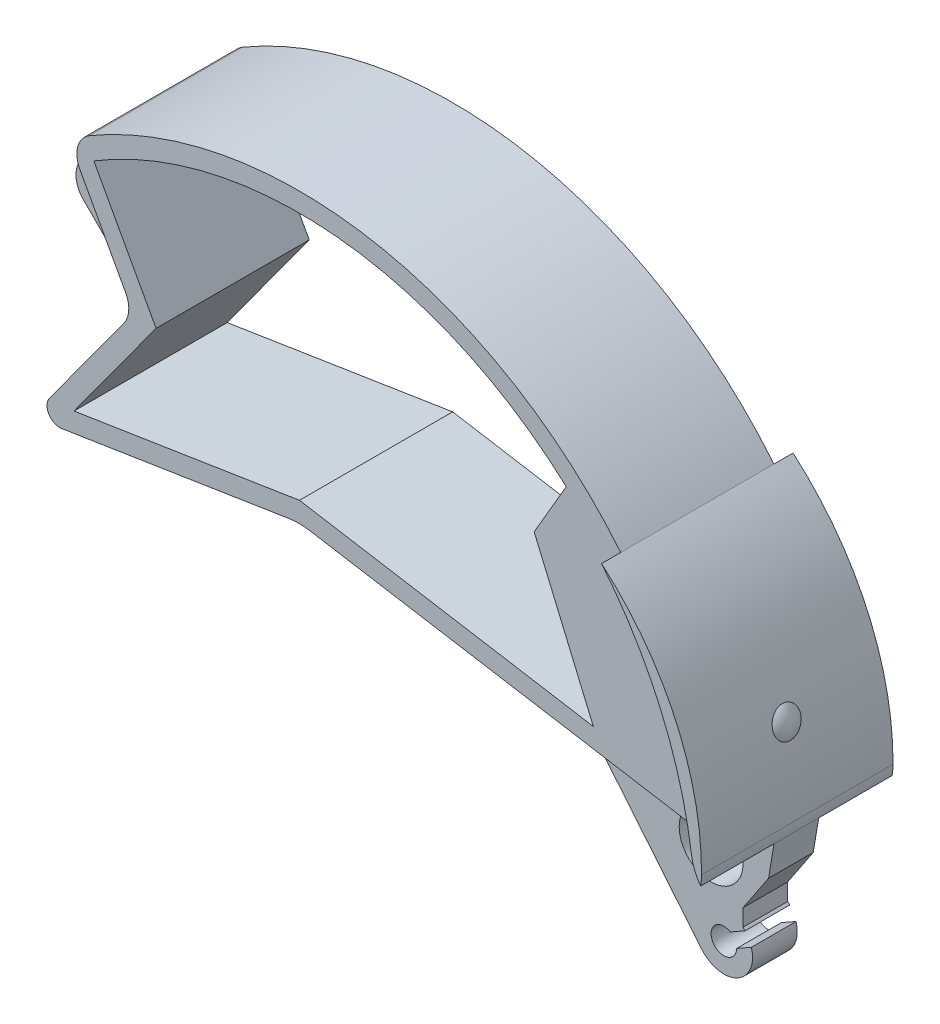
ISO-10303-21;
HEADER;
FILE_DESCRIPTION(('STEP AP214'),'2;1');
FILE_NAME('part.step','',(''),(''),'','','');
FILE_SCHEMA(('AUTOMOTIVE_DESIGN { 1 0 10303 214 1 1 1 1 }'));
ENDSEC;
DATA;
#1=APPLICATION_CONTEXT('core data for automotive mechanical design processes');
#2=APPLICATION_PROTOCOL_DEFINITION('international standard','automotive_design',2000,#1);
#3=PRODUCT_CONTEXT('',#1,'mechanical');
#4=PRODUCT('Part','Part','',(#3));
#5=PRODUCT_RELATED_PRODUCT_CATEGORY('part','',(#4));
#6=PRODUCT_DEFINITION_FORMATION('','',#4);
#7=PRODUCT_DEFINITION_CONTEXT('part definition',#1,'design');
#8=PRODUCT_DEFINITION('design','',#6,#7);
#9=PRODUCT_DEFINITION_SHAPE('','',#8);
#10=(LENGTH_UNIT() NAMED_UNIT(*) SI_UNIT(.MILLI.,.METRE.));
#11=(NAMED_UNIT(*) PLANE_ANGLE_UNIT() SI_UNIT($,.RADIAN.));
#12=(NAMED_UNIT(*) SI_UNIT($,.STERADIAN.) SOLID_ANGLE_UNIT());
#13=UNCERTAINTY_MEASURE_WITH_UNIT(LENGTH_MEASURE(1.E-05),#10,'distance_accuracy_value','');
#14=(GEOMETRIC_REPRESENTATION_CONTEXT(3) GLOBAL_UNCERTAINTY_ASSIGNED_CONTEXT((#13)) GLOBAL_UNIT_ASSIGNED_CONTEXT((#10,
#11,#12)) REPRESENTATION_CONTEXT('',''));
#15=CARTESIAN_POINT('',(0.,0.,0.));
#16=DIRECTION('',(0.,0.,1.));
#17=DIRECTION('',(1.,0.,0.));
#18=AXIS2_PLACEMENT_3D('',#15,#16,#17);
#19=CARTESIAN_POINT('',(10.5,3.5,7.5));
#20=DIRECTION('',(0.,0.,-1.));
#21=DIRECTION('',(-1.,0.,0.));
#22=AXIS2_PLACEMENT_3D('',#19,#20,#21);
#23=CYLINDRICAL_SURFACE('',#22,22.5);
#24=CARTESIAN_POINT('',(10.5,3.5,7.5));
#25=DIRECTION('',(0.,0.,1.));
#26=DIRECTION('',(1.,0.,0.));
#27=AXIS2_PLACEMENT_3D('',#24,#25,#26);
#28=CIRCLE('',#27,22.5);
#29=CARTESIAN_POINT('',(32.9995400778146,3.35613795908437,7.5));
#30=VERTEX_POINT('',#29);
#31=CARTESIAN_POINT('',(25.1707017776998,20.5593232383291,7.5));
#32=VERTEX_POINT('',#31);
#33=EDGE_CURVE('E404',#30,#32,#28,.T.);
#34=ORIENTED_EDGE('',*,*,#33,.F.);
#35=DIRECTION('',(0.,0.,-1.));
#36=VECTOR('',#35,1.);
#37=CARTESIAN_POINT('',(32.9995400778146,3.35613795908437,7.5));
#38=LINE('',#37,#36);
#39=CARTESIAN_POINT('',(32.9995400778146,3.35613795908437,-7.5));
#40=VERTEX_POINT('',#39);
#41=EDGE_CURVE('E577',#30,#40,#38,.T.);
#42=ORIENTED_EDGE('',*,*,#41,.T.);
#43=CARTESIAN_POINT('',(10.5,3.5,-7.5));
#44=DIRECTION('',(0.,0.,1.));
#45=DIRECTION('',(1.,0.,0.));
#46=AXIS2_PLACEMENT_3D('',#43,#44,#45);
#47=CIRCLE('',#46,22.5);
#48=CARTESIAN_POINT('',(25.1707017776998,20.5593232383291,-7.5));
#49=VERTEX_POINT('',#48);
#50=EDGE_CURVE('E399',#40,#49,#47,.T.);
#51=ORIENTED_EDGE('',*,*,#50,.T.);
#52=DIRECTION('',(0.,0.,-1.));
#53=VECTOR('',#52,1.);
#54=CARTESIAN_POINT('',(25.1707017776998,20.5593232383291,7.5));
#55=LINE('',#54,#53);
#56=CARTESIAN_POINT('',(25.1707017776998,20.5593232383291,-6.));
#57=VERTEX_POINT('',#56);
#58=EDGE_CURVE('E406',#57,#49,#55,.T.);
#59=ORIENTED_EDGE('',*,*,#58,.F.);
#60=CARTESIAN_POINT('',(25.1707017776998,20.5593232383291,6.));
#61=VERTEX_POINT('',#60);
#62=EDGE_CURVE('E411',#61,#57,#55,.T.);
#63=ORIENTED_EDGE('',*,*,#62,.F.);
#64=EDGE_CURVE('E407',#32,#61,#55,.T.);
#65=ORIENTED_EDGE('',*,*,#64,.F.);
#66=EDGE_LOOP('',(#34,#42,#51,#59,#63,#65));
#67=FACE_BOUND('',#66,.T.);
#68=CARTESIAN_POINT('',(32.1700653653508,9.55460743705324,1.09487466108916));
#69=CARTESIAN_POINT('',(32.1874013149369,9.49255912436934,1.09487273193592));
#70=CARTESIAN_POINT('',(32.2044780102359,9.43040253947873,1.08964615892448));
#71=CARTESIAN_POINT('',(32.2376753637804,9.30754064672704,1.06882572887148));
#72=CARTESIAN_POINT('',(32.2537951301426,9.24683672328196,1.05322236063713));
#73=CARTESIAN_POINT('',(32.2846994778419,9.12855282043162,1.01194172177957));
#74=CARTESIAN_POINT('',(32.2994835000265,9.07097415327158,0.986260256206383));
#75=CARTESIAN_POINT('',(32.3273796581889,8.96065360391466,0.925371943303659));
#76=CARTESIAN_POINT('',(32.3404920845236,8.90791088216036,0.890166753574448));
#77=CARTESIAN_POINT('',(32.364890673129,8.80840930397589,0.810650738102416));
#78=CARTESIAN_POINT('',(32.3761576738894,8.76171417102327,0.766254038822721));
#79=CARTESIAN_POINT('',(32.3964675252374,8.67654637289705,0.669724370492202));
#80=CARTESIAN_POINT('',(32.4055106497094,8.63807269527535,0.617592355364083));
#81=CARTESIAN_POINT('',(32.4208666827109,8.57215019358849,0.509316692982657));
#82=CARTESIAN_POINT('',(32.427274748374,8.54432028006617,0.453418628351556));
#83=CARTESIAN_POINT('',(32.437740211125,8.49861069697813,0.337488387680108));
#84=CARTESIAN_POINT('',(32.4417982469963,8.48072832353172,0.277457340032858));
#85=CARTESIAN_POINT('',(32.4473748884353,8.4560962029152,0.15745913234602));
#86=CARTESIAN_POINT('',(32.448985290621,8.44894416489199,0.0975785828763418));
#87=CARTESIAN_POINT('',(32.4499307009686,8.44474952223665,-0.0225500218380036));
#88=CARTESIAN_POINT('',(32.4492660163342,8.44770555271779,-0.0827980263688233));
#89=CARTESIAN_POINT('',(32.4457068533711,8.46346778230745,-0.200806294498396));
#90=CARTESIAN_POINT('',(32.4428528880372,8.47609500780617,-0.258591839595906));
#91=CARTESIAN_POINT('',(32.4350150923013,8.51053112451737,-0.371201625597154));
#92=CARTESIAN_POINT('',(32.4300312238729,8.53234017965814,-0.426025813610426));
#93=CARTESIAN_POINT('',(32.4179615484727,8.58465195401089,-0.531785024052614));
#94=CARTESIAN_POINT('',(32.4108553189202,8.61523902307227,-0.582675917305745));
#95=CARTESIAN_POINT('',(32.3946861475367,8.68401031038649,-0.678679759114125));
#96=CARTESIAN_POINT('',(32.3856229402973,8.72219555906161,-0.72379192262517));
#97=CARTESIAN_POINT('',(32.3653744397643,8.80634801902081,-0.80855238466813));
#98=CARTESIAN_POINT('',(32.3541296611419,8.852528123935,-0.847974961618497));
#99=CARTESIAN_POINT('',(32.329936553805,8.95035847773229,-0.918660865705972));
#100=CARTESIAN_POINT('',(32.3169878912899,9.0020097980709,-0.949922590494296));
#101=CARTESIAN_POINT('',(32.2890744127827,9.11155556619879,-1.00474576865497));
#102=CARTESIAN_POINT('',(32.2740486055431,9.16961935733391,-1.02793792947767));
#103=CARTESIAN_POINT('',(32.2427508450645,9.28848544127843,-1.06429917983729));
#104=CARTESIAN_POINT('',(32.2264786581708,9.34928824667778,-1.07746638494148));
#105=CARTESIAN_POINT('',(32.1925169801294,9.47402862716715,-1.09378133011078));
#106=CARTESIAN_POINT('',(32.1747984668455,9.53800350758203,-1.09658498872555));
#107=CARTESIAN_POINT('',(32.1389157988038,9.66536309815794,-1.09116034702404));
#108=CARTESIAN_POINT('',(32.1207515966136,9.72874774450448,-1.08293086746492));
#109=CARTESIAN_POINT('',(32.084317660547,9.85385894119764,-1.05545311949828));
#110=CARTESIAN_POINT('',(32.0660489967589,9.91555924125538,-1.03608342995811));
#111=CARTESIAN_POINT('',(32.0302320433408,10.0347519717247,-0.986654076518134));
#112=CARTESIAN_POINT('',(32.0126837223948,10.0922445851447,-0.956594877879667));
#113=CARTESIAN_POINT('',(31.9792502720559,10.2003703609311,-0.887060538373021));
#114=CARTESIAN_POINT('',(31.9633428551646,10.251099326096,-0.847745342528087));
#115=CARTESIAN_POINT('',(31.9335361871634,10.3451416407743,-0.760432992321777));
#116=CARTESIAN_POINT('',(31.9196365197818,10.3884565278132,-0.712437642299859));
#117=CARTESIAN_POINT('',(31.8949566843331,10.4647239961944,-0.611020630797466));
#118=CARTESIAN_POINT('',(31.8840795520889,10.4980026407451,-0.557867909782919));
#119=CARTESIAN_POINT('',(31.8652957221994,10.5551434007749,-0.446240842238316));
#120=CARTESIAN_POINT('',(31.8573882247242,10.5790080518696,-0.387767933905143));
#121=CARTESIAN_POINT('',(31.8452015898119,10.6156678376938,-0.269778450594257));
#122=CARTESIAN_POINT('',(31.8407855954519,10.6288809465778,-0.210405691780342));
#123=CARTESIAN_POINT('',(31.8352658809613,10.6453836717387,-0.0901488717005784));
#124=CARTESIAN_POINT('',(31.8341615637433,10.6486750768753,-0.0292650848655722));
#125=CARTESIAN_POINT('',(31.8353040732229,10.6452642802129,0.0906036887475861));
#126=CARTESIAN_POINT('',(31.8374648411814,10.6388187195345,0.149597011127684));
#127=CARTESIAN_POINT('',(31.8448766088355,10.6166268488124,0.26560227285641));
#128=CARTESIAN_POINT('',(31.8501275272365,10.6008807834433,0.32261426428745));
#129=CARTESIAN_POINT('',(31.8634860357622,10.5605886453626,0.433156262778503));
#130=CARTESIAN_POINT('',(31.8715971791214,10.5360316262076,0.48668184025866));
#131=CARTESIAN_POINT('',(31.8903200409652,10.4789045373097,0.588782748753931));
#132=CARTESIAN_POINT('',(31.9009319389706,10.4463338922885,0.637357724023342));
#133=CARTESIAN_POINT('',(31.9245371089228,10.3731885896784,0.729600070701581));
#134=CARTESIAN_POINT('',(31.9375862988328,10.3324237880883,0.773102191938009));
#135=CARTESIAN_POINT('',(31.9653611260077,10.2446562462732,0.852652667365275));
#136=CARTESIAN_POINT('',(31.9800873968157,10.1976511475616,0.888698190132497));
#137=CARTESIAN_POINT('',(32.0113154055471,10.096681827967,0.953853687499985));
#138=CARTESIAN_POINT('',(32.0278649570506,10.0425125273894,0.982622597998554));
#139=CARTESIAN_POINT('',(32.0616360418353,9.93034003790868,1.03061851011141));
#140=CARTESIAN_POINT('',(32.0788570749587,9.87233968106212,1.04985247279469));
#141=CARTESIAN_POINT('',(32.1085077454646,9.77091235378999,1.07435577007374));
#142=CARTESIAN_POINT('',(32.1209043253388,9.72804241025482,1.08204264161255));
#143=CARTESIAN_POINT('',(32.1455983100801,9.64166856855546,1.09230272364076));
#144=CARTESIAN_POINT('',(32.157895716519,9.59816468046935,1.09487601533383));
#145=CARTESIAN_POINT('',(32.1700653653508,9.55460743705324,1.09487466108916));
#146=B_SPLINE_CURVE_WITH_KNOTS('',3,(#68,#69,#70,#71,#72,#73,#74,#75,#76,#77,#78,#79,#80,#81,
#82,#83,#84,#85,#86,#87,#88,#89,#90,#91,#92,#93,#94,#95,#96,#97,#98,#99,#100,#101,#102,#103,
#104,#105,#106,#107,#108,#109,#110,#111,#112,#113,#114,#115,#116,#117,#118,#119,#120,#121,#122,
#123,#124,#125,#126,#127,#128,#129,#130,#131,#132,#133,#134,#135,#136,#137,#138,#139,#140,#141,
#142,#143,#144,#145),.UNSPECIFIED.,.T.,.F.,(4,2,2,2,2,2,2,2,2,2,2,2,2,2,2,2,2,2,2,2,2,2,2,2,2,2,
2,2,2,2,2,2,2,2,2,2,2,2,4),(0.,0.193121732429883,0.386420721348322,0.579800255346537,
0.773146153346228,0.968387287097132,1.16360436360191,1.35097210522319,1.53828889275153,
1.71839031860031,1.89846742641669,2.07529025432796,2.25211623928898,2.43070179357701,
2.60931158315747,2.7937367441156,2.97819808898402,3.17024086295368,3.36231972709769,
3.56072131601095,3.7591441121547,3.95977171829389,4.1603905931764,4.35776875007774,
4.55510592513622,4.74508760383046,4.93501807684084,5.1170729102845,5.29909491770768,
5.47640228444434,5.65370498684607,5.83122873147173,6.00876522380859,6.19103219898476,
6.37336825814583,6.56310836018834,6.75270973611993,6.88828125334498,7.02385061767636),.UNSPECIFIED.);
#147=CARTESIAN_POINT('',(32.1700653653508,9.55460743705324,1.09487466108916));
#148=VERTEX_POINT('',#147);
#149=EDGE_CURVE('E12',#148,#148,#146,.T.);
#150=ORIENTED_EDGE('',*,*,#149,.F.);
#151=EDGE_LOOP('',(#150));
#152=FACE_BOUND('',#151,.T.);
#153=ADVANCED_FACE('F40',(#67,#152),#23,.T.);
#154=CARTESIAN_POINT('',(-15.3627125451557,17.8362685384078,6.));
#155=DIRECTION('',(0.,0.,1.));
#156=DIRECTION('',(1.,0.,0.));
#157=AXIS2_PLACEMENT_3D('',#154,#155,#156);
#158=CYLINDRICAL_SURFACE('',#157,2.);
#159=CARTESIAN_POINT('',(-15.3627125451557,17.8362685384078,0.));
#160=DIRECTION('',(0.,0.,1.));
#161=DIRECTION('',(1.,0.,0.));
#162=AXIS2_PLACEMENT_3D('',#159,#160,#161);
#163=CIRCLE('',#162,2.);
#164=CARTESIAN_POINT('',(-13.7461038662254,16.6587387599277,0.));
#165=VERTEX_POINT('',#164);
#166=CARTESIAN_POINT('',(-13.6075616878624,18.7951457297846,0.));
#167=VERTEX_POINT('',#166);
#168=EDGE_CURVE('E734',#165,#167,#163,.T.);
#169=ORIENTED_EDGE('',*,*,#168,.T.);
#170=DIRECTION('',(0.,0.,-1.));
#171=VECTOR('',#170,1.);
#172=CARTESIAN_POINT('',(-13.6075616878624,18.7951457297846,6.));
#173=LINE('',#172,#171);
#174=CARTESIAN_POINT('',(-13.6075616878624,18.7951457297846,-6.));
#175=VERTEX_POINT('',#174);
#176=EDGE_CURVE('E608',#175,#167,#173,.F.);
#177=ORIENTED_EDGE('',*,*,#176,.F.);
#178=CARTESIAN_POINT('',(-15.3627125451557,17.8362685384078,-6.));
#179=DIRECTION('',(0.,0.,1.));
#180=DIRECTION('',(1.,0.,0.));
#181=AXIS2_PLACEMENT_3D('',#178,#179,#180);
#182=CIRCLE('',#181,2.);
#183=CARTESIAN_POINT('',(-13.7461038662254,16.6587387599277,-6.));
#184=VERTEX_POINT('',#183);
#185=EDGE_CURVE('E623',#184,#175,#182,.T.);
#186=ORIENTED_EDGE('',*,*,#185,.F.);
#187=DIRECTION('',(0.,0.,-1.));
#188=VECTOR('',#187,1.);
#189=CARTESIAN_POINT('',(-13.7461038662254,16.6587387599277,-6.));
#190=LINE('',#189,#188);
#191=EDGE_CURVE('E619',#165,#184,#190,.T.);
#192=ORIENTED_EDGE('',*,*,#191,.F.);
#193=EDGE_LOOP('',(#169,#177,#186,#192));
#194=FACE_BOUND('',#193,.T.);
#195=ADVANCED_FACE('F666',(#194),#158,.F.);
#196=CARTESIAN_POINT('',(0.,0.,6.));
#197=DIRECTION('',(0.,0.,-1.));
#198=DIRECTION('',(-1.,0.,0.));
#199=AXIS2_PLACEMENT_3D('',#196,#197,#198);
#200=CYLINDRICAL_SURFACE('',#199,32.5);
#201=CARTESIAN_POINT('',(0.,0.,-6.));
#202=DIRECTION('',(0.,0.,1.));
#203=DIRECTION('',(1.,0.,0.));
#204=AXIS2_PLACEMENT_3D('',#201,#202,#203);
#205=CIRCLE('',#204,32.5);
#206=CARTESIAN_POINT('',(-16.4446717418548,28.0325305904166,-6.));
#207=VERTEX_POINT('',#206);
#208=EDGE_CURVE('E501',#57,#207,#205,.T.);
#209=ORIENTED_EDGE('',*,*,#208,.T.);
#210=DIRECTION('',(0.,0.,-1.));
#211=VECTOR('',#210,1.);
#212=CARTESIAN_POINT('',(-16.4446717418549,28.0325305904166,6.));
#213=LINE('',#212,#211);
#214=CARTESIAN_POINT('',(-16.4446717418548,28.0325305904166,6.));
#215=VERTEX_POINT('',#214);
#216=EDGE_CURVE('E615',#207,#215,#213,.F.);
#217=ORIENTED_EDGE('',*,*,#216,.T.);
#218=CARTESIAN_POINT('',(0.,0.,6.));
#219=DIRECTION('',(0.,0.,1.));
#220=DIRECTION('',(1.,0.,0.));
#221=AXIS2_PLACEMENT_3D('',#218,#219,#220);
#222=CIRCLE('',#221,32.5);
#223=EDGE_CURVE('E514',#61,#215,#222,.T.);
#224=ORIENTED_EDGE('',*,*,#223,.F.);
#225=ORIENTED_EDGE('',*,*,#62,.T.);
#226=EDGE_LOOP('',(#209,#217,#224,#225));
#227=FACE_BOUND('',#226,.T.);
#228=ADVANCED_FACE('F680',(#227),#200,.T.);
#229=CARTESIAN_POINT('',(15.,7.5,6.));
#230=DIRECTION('',(0.77275302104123,0.63470683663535,0.));
#231=DIRECTION('',(-0.63470683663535,0.77275302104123,0.));
#232=AXIS2_PLACEMENT_3D('',#229,#230,#231);
#233=PLANE('',#232);
#234=DIRECTION('',(-0.63470683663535,0.77275302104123,0.));
#235=VECTOR('',#234,1.);
#236=CARTESIAN_POINT('',(15.,7.5,-1.75));
#237=LINE('',#236,#235);
#238=CARTESIAN_POINT('',(27.2613057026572,-7.42809038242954,-1.75));
#239=VERTEX_POINT('',#238);
#240=CARTESIAN_POINT('',(15.,7.5,-1.75));
#241=VERTEX_POINT('',#240);
#242=EDGE_CURVE('E469',#239,#241,#237,.T.);
#243=ORIENTED_EDGE('',*,*,#242,.F.);
#244=DIRECTION('',(0.,0.,-1.));
#245=VECTOR('',#244,1.);
#246=CARTESIAN_POINT('',(27.2613057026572,-7.42809038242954,6.));
#247=LINE('',#246,#245);
#248=CARTESIAN_POINT('',(27.2613057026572,-7.42809038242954,1.75));
#249=VERTEX_POINT('',#248);
#250=EDGE_CURVE('E545',#249,#239,#247,.T.);
#251=ORIENTED_EDGE('',*,*,#250,.F.);
#252=DIRECTION('',(0.63470683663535,-0.77275302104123,0.));
#253=VECTOR('',#252,1.);
#254=CARTESIAN_POINT('',(15.,7.5,1.75));
#255=LINE('',#254,#253);
#256=CARTESIAN_POINT('',(15.,7.5,1.75));
#257=VERTEX_POINT('',#256);
#258=EDGE_CURVE('E495',#257,#249,#255,.T.);
#259=ORIENTED_EDGE('',*,*,#258,.F.);
#260=DIRECTION('',(0.,0.,-1.));
#261=VECTOR('',#260,1.);
#262=CARTESIAN_POINT('',(15.,7.5,6.));
#263=LINE('',#262,#261);
#264=EDGE_CURVE('E548',#257,#241,#263,.T.);
#265=ORIENTED_EDGE('',*,*,#264,.T.);
#266=EDGE_LOOP('',(#243,#251,#259,#265));
#267=FACE_BOUND('',#266,.T.);
#268=ADVANCED_FACE('F824',(#267),#233,.F.);
#269=CARTESIAN_POINT('',(29.,-6.,6.));
#270=DIRECTION('',(0.,0.,-1.));
#271=DIRECTION('',(-1.,0.,0.));
#272=AXIS2_PLACEMENT_3D('',#269,#270,#271);
#273=CYLINDRICAL_SURFACE('',#272,2.25);
#274=CARTESIAN_POINT('',(29.,-6.,-1.75));
#275=DIRECTION('',(0.,0.,-1.));
#276=DIRECTION('',(-1.,0.,0.));
#277=AXIS2_PLACEMENT_3D('',#274,#275,#276);
#278=CIRCLE('',#277,2.25);
#279=CARTESIAN_POINT('',(31.1551075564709,-5.35346197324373,-1.75));
#280=VERTEX_POINT('',#279);
#281=EDGE_CURVE('E467',#280,#239,#278,.T.);
#282=ORIENTED_EDGE('',*,*,#281,.F.);
#283=DIRECTION('',(0.,0.,-1.));
#284=VECTOR('',#283,1.);
#285=CARTESIAN_POINT('',(31.1551075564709,-5.35346197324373,6.));
#286=LINE('',#285,#284);
#287=CARTESIAN_POINT('',(31.1551075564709,-5.35346197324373,1.75));
#288=VERTEX_POINT('',#287);
#289=EDGE_CURVE('E542',#288,#280,#286,.T.);
#290=ORIENTED_EDGE('',*,*,#289,.F.);
#291=CARTESIAN_POINT('',(29.,-6.,1.75));
#292=DIRECTION('',(0.,0.,1.));
#293=DIRECTION('',(1.,0.,0.));
#294=AXIS2_PLACEMENT_3D('',#291,#292,#293);
#295=CIRCLE('',#294,2.25);
#296=EDGE_CURVE('E493',#249,#288,#295,.T.);
#297=ORIENTED_EDGE('',*,*,#296,.F.);
#298=ORIENTED_EDGE('',*,*,#250,.T.);
#299=EDGE_LOOP('',(#282,#290,#297,#298));
#300=FACE_BOUND('',#299,.T.);
#301=ADVANCED_FACE('F847',(#300),#273,.T.);
#302=CARTESIAN_POINT('',(29.9999676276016,-6.00804635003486,6.));
#303=DIRECTION('',(0.493015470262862,-0.870020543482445,0.));
#304=DIRECTION('',(0.870020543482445,0.493015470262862,0.));
#305=AXIS2_PLACEMENT_3D('',#302,#303,#304);
#306=PLANE('',#305);
#307=DIRECTION('',(0.870020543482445,0.493015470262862,0.));
#308=VECTOR('',#307,1.);
#309=CARTESIAN_POINT('',(29.9999676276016,-6.00804635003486,-1.75));
#310=LINE('',#309,#308);
#311=CARTESIAN_POINT('',(29.9999676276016,-6.00804635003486,-1.75));
#312=VERTEX_POINT('',#311);
#313=EDGE_CURVE('E465',#312,#280,#310,.T.);
#314=ORIENTED_EDGE('',*,*,#313,.F.);
#315=DIRECTION('',(0.,0.,-1.));
#316=VECTOR('',#315,1.);
#317=CARTESIAN_POINT('',(29.9999676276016,-6.00804635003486,6.));
#318=LINE('',#317,#316);
#319=CARTESIAN_POINT('',(29.9999676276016,-6.00804635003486,1.75));
#320=VERTEX_POINT('',#319);
#321=EDGE_CURVE('E539',#320,#312,#318,.T.);
#322=ORIENTED_EDGE('',*,*,#321,.F.);
#323=DIRECTION('',(-0.870020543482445,-0.493015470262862,0.));
#324=VECTOR('',#323,1.);
#325=CARTESIAN_POINT('',(29.9999676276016,-6.00804635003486,1.75));
#326=LINE('',#325,#324);
#327=EDGE_CURVE('E491',#288,#320,#326,.T.);
#328=ORIENTED_EDGE('',*,*,#327,.F.);
#329=ORIENTED_EDGE('',*,*,#289,.T.);
#330=EDGE_LOOP('',(#314,#322,#328,#329));
#331=FACE_BOUND('',#330,.T.);
#332=ADVANCED_FACE('F843',(#331),#306,.F.);
#333=CARTESIAN_POINT('',(29.,-6.,6.));
#334=DIRECTION('',(0.,0.,-1.));
#335=DIRECTION('',(-1.,0.,0.));
#336=AXIS2_PLACEMENT_3D('',#333,#334,#335);
#337=CYLINDRICAL_SURFACE('',#336,0.999999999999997);
#338=CARTESIAN_POINT('',(29.,-6.,-1.75));
#339=DIRECTION('',(0.,0.,-1.));
#340=DIRECTION('',(-1.,0.,0.));
#341=AXIS2_PLACEMENT_3D('',#338,#339,#340);
#342=CIRCLE('',#341,0.999999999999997);
#343=CARTESIAN_POINT('',(29.5069521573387,-5.13802580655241,-1.75));
#344=VERTEX_POINT('',#343);
#345=EDGE_CURVE('E463',#344,#312,#342,.F.);
#346=ORIENTED_EDGE('',*,*,#345,.F.);
#347=DIRECTION('',(0.,0.,-1.));
#348=VECTOR('',#347,1.);
#349=CARTESIAN_POINT('',(29.5069521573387,-5.13802580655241,6.));
#350=LINE('',#349,#348);
#351=CARTESIAN_POINT('',(29.5069521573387,-5.13802580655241,1.75));
#352=VERTEX_POINT('',#351);
#353=EDGE_CURVE('E536',#352,#344,#350,.T.);
#354=ORIENTED_EDGE('',*,*,#353,.F.);
#355=CARTESIAN_POINT('',(29.,-6.,1.75));
#356=DIRECTION('',(0.,0.,1.));
#357=DIRECTION('',(1.,0.,0.));
#358=AXIS2_PLACEMENT_3D('',#355,#356,#357);
#359=CIRCLE('',#358,0.999999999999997);
#360=EDGE_CURVE('E488',#320,#352,#359,.F.);
#361=ORIENTED_EDGE('',*,*,#360,.F.);
#362=ORIENTED_EDGE('',*,*,#321,.T.);
#363=EDGE_LOOP('',(#346,#354,#361,#362));
#364=FACE_BOUND('',#363,.T.);
#365=ADVANCED_FACE('F839',(#364),#337,.F.);
#366=CARTESIAN_POINT('',(29.5069521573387,-5.13802580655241,6.));
#367=DIRECTION('',(-0.493015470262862,0.870020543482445,0.));
#368=DIRECTION('',(-0.870020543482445,-0.493015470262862,0.));
#369=AXIS2_PLACEMENT_3D('',#366,#367,#368);
#370=PLANE('',#369);
#371=DIRECTION('',(-0.870020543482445,-0.493015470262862,0.));
#372=VECTOR('',#371,1.);
#373=CARTESIAN_POINT('',(29.5069521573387,-5.13802580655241,-1.75));
#374=LINE('',#373,#372);
#375=CARTESIAN_POINT('',(30.6620920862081,-4.48344142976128,-1.75));
#376=VERTEX_POINT('',#375);
#377=EDGE_CURVE('E461',#376,#344,#374,.T.);
#378=ORIENTED_EDGE('',*,*,#377,.F.);
#379=DIRECTION('',(0.,0.,-1.));
#380=VECTOR('',#379,1.);
#381=CARTESIAN_POINT('',(30.6620920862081,-4.48344142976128,6.));
#382=LINE('',#381,#380);
#383=CARTESIAN_POINT('',(30.6620920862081,-4.48344142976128,1.75));
#384=VERTEX_POINT('',#383);
#385=EDGE_CURVE('E533',#384,#376,#382,.T.);
#386=ORIENTED_EDGE('',*,*,#385,.F.);
#387=DIRECTION('',(0.870020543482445,0.493015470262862,0.));
#388=VECTOR('',#387,1.);
#389=CARTESIAN_POINT('',(29.5069521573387,-5.13802580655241,1.75));
#390=LINE('',#389,#388);
#391=EDGE_CURVE('E486',#352,#384,#390,.T.);
#392=ORIENTED_EDGE('',*,*,#391,.F.);
#393=ORIENTED_EDGE('',*,*,#353,.T.);
#394=EDGE_LOOP('',(#378,#386,#392,#393));
#395=FACE_BOUND('',#394,.T.);
#396=ADVANCED_FACE('F835',(#395),#370,.F.);
#397=CARTESIAN_POINT('',(29.,-6.,6.));
#398=DIRECTION('',(0.,0.,-1.));
#399=DIRECTION('',(-1.,0.,0.));
#400=AXIS2_PLACEMENT_3D('',#397,#398,#399);
#401=CYLINDRICAL_SURFACE('',#400,2.25);
#402=CARTESIAN_POINT('',(29.,-6.,-1.75));
#403=DIRECTION('',(0.,0.,-1.));
#404=DIRECTION('',(-1.,0.,0.));
#405=AXIS2_PLACEMENT_3D('',#402,#403,#404);
#406=CIRCLE('',#405,2.25);
#407=CARTESIAN_POINT('',(30.5,-4.32294901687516,-1.75));
#408=VERTEX_POINT('',#407);
#409=EDGE_CURVE('E459',#408,#376,#406,.T.);
#410=ORIENTED_EDGE('',*,*,#409,.F.);
#411=DIRECTION('',(0.,0.,-1.));
#412=VECTOR('',#411,1.);
#413=CARTESIAN_POINT('',(30.5,-4.32294901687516,6.));
#414=LINE('',#413,#412);
#415=CARTESIAN_POINT('',(30.5,-4.32294901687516,1.75));
#416=VERTEX_POINT('',#415);
#417=EDGE_CURVE('E530',#416,#408,#414,.T.);
#418=ORIENTED_EDGE('',*,*,#417,.F.);
#419=CARTESIAN_POINT('',(29.,-6.,1.75));
#420=DIRECTION('',(0.,0.,1.));
#421=DIRECTION('',(1.,0.,0.));
#422=AXIS2_PLACEMENT_3D('',#419,#420,#421);
#423=CIRCLE('',#422,2.25);
#424=EDGE_CURVE('E484',#384,#416,#423,.T.);
#425=ORIENTED_EDGE('',*,*,#424,.F.);
#426=ORIENTED_EDGE('',*,*,#385,.T.);
#427=EDGE_LOOP('',(#410,#418,#425,#426));
#428=FACE_BOUND('',#427,.T.);
#429=ADVANCED_FACE('F831',(#428),#401,.T.);
#430=CARTESIAN_POINT('',(30.5,-2.99811188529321,6.));
#431=DIRECTION('',(-1.,0.,0.));
#432=DIRECTION('',(0.,0.,1.));
#433=AXIS2_PLACEMENT_3D('',#430,#431,#432);
#434=PLANE('',#433);
#435=DIRECTION('',(0.,-1.,0.));
#436=VECTOR('',#435,1.);
#437=CARTESIAN_POINT('',(30.5,-2.99811188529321,-1.75));
#438=LINE('',#437,#436);
#439=CARTESIAN_POINT('',(30.5,-2.99811188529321,-1.75));
#440=VERTEX_POINT('',#439);
#441=EDGE_CURVE('E457',#440,#408,#438,.T.);
#442=ORIENTED_EDGE('',*,*,#441,.F.);
#443=DIRECTION('',(0.,0.,-1.));
#444=VECTOR('',#443,1.);
#445=CARTESIAN_POINT('',(30.5,-2.99811188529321,6.));
#446=LINE('',#445,#444);
#447=CARTESIAN_POINT('',(30.5,-2.99811188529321,1.75));
#448=VERTEX_POINT('',#447);
#449=EDGE_CURVE('E527',#448,#440,#446,.T.);
#450=ORIENTED_EDGE('',*,*,#449,.F.);
#451=DIRECTION('',(0.,1.,0.));
#452=VECTOR('',#451,1.);
#453=CARTESIAN_POINT('',(30.5,-2.99811188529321,1.75));
#454=LINE('',#453,#452);
#455=EDGE_CURVE('E482',#416,#448,#454,.T.);
#456=ORIENTED_EDGE('',*,*,#455,.F.);
#457=ORIENTED_EDGE('',*,*,#417,.T.);
#458=EDGE_LOOP('',(#442,#450,#456,#457));
#459=FACE_BOUND('',#458,.T.);
#460=ADVANCED_FACE('F827',(#459),#434,.F.);
#461=CARTESIAN_POINT('',(32.5,0.,6.));
#462=DIRECTION('',(-0.831889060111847,0.554941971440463,0.));
#463=DIRECTION('',(-0.554941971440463,-0.831889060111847,0.));
#464=AXIS2_PLACEMENT_3D('',#461,#462,#463);
#465=PLANE('',#464);
#466=DIRECTION('',(-0.554941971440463,-0.831889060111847,0.));
#467=VECTOR('',#466,1.);
#468=CARTESIAN_POINT('',(32.5,0.,-1.75));
#469=LINE('',#468,#467);
#470=CARTESIAN_POINT('',(32.5,0.,-1.75));
#471=VERTEX_POINT('',#470);
#472=EDGE_CURVE('E455',#471,#440,#469,.T.);
#473=ORIENTED_EDGE('',*,*,#472,.F.);
#474=DIRECTION('',(0.,0.,-1.));
#475=VECTOR('',#474,1.);
#476=CARTESIAN_POINT('',(32.5,0.,6.));
#477=LINE('',#476,#475);
#478=CARTESIAN_POINT('',(32.5,0.,1.75));
#479=VERTEX_POINT('',#478);
#480=EDGE_CURVE('E524',#479,#471,#477,.T.);
#481=ORIENTED_EDGE('',*,*,#480,.F.);
#482=DIRECTION('',(0.554941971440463,0.831889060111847,0.));
#483=VECTOR('',#482,1.);
#484=CARTESIAN_POINT('',(32.5,0.,1.75));
#485=LINE('',#484,#483);
#486=EDGE_CURVE('E479',#448,#479,#485,.T.);
#487=ORIENTED_EDGE('',*,*,#486,.F.);
#488=ORIENTED_EDGE('',*,*,#449,.T.);
#489=EDGE_LOOP('',(#473,#481,#487,#488));
#490=FACE_BOUND('',#489,.T.);
#491=ADVANCED_FACE('F810',(#490),#465,.F.);
#492=CARTESIAN_POINT('',(28.,0.,6.));
#493=DIRECTION('',(0.,0.,-1.));
#494=DIRECTION('',(-1.,0.,0.));
#495=AXIS2_PLACEMENT_3D('',#492,#493,#494);
#496=CYLINDRICAL_SURFACE('',#495,2.5);
#497=CARTESIAN_POINT('',(28.,0.,1.75));
#498=DIRECTION('',(0.,0.,1.));
#499=DIRECTION('',(1.,0.,0.));
#500=AXIS2_PLACEMENT_3D('',#497,#498,#499);
#501=CIRCLE('',#500,2.5);
#502=CARTESIAN_POINT('',(30.5,0.,1.75));
#503=VERTEX_POINT('',#502);
#504=EDGE_CURVE('E476',#503,#503,#501,.T.);
#505=ORIENTED_EDGE('',*,*,#504,.T.);
#506=EDGE_LOOP('',(#505));
#507=FACE_BOUND('',#506,.T.);
#508=CARTESIAN_POINT('',(28.,0.,-1.75));
#509=DIRECTION('',(0.,0.,-1.));
#510=DIRECTION('',(-1.,0.,0.));
#511=AXIS2_PLACEMENT_3D('',#508,#509,#510);
#512=CIRCLE('',#511,2.5);
#513=CARTESIAN_POINT('',(25.5,0.,-1.75));
#514=VERTEX_POINT('',#513);
#515=EDGE_CURVE('E471',#514,#514,#512,.T.);
#516=ORIENTED_EDGE('',*,*,#515,.T.);
#517=EDGE_LOOP('',(#516));
#518=FACE_BOUND('',#517,.T.);
#519=ADVANCED_FACE('F807',(#507,#518),#496,.F.);
#520=CARTESIAN_POINT('',(0.,0.,-6.));
#521=DIRECTION('',(0.,0.,1.));
#522=DIRECTION('',(1.,0.,0.));
#523=AXIS2_PLACEMENT_3D('',#520,#521,#522);
#524=PLANE('',#523);
#525=DIRECTION('',(0.503339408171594,0.864088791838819,0.));
#526=VECTOR('',#525,1.);
#527=CARTESIAN_POINT('',(5.65228769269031,-3.29250786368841,-6.));
#528=LINE('',#527,#526);
#529=CARTESIAN_POINT('',(18.3893534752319,18.5733655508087,-6.00000000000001));
#530=VERTEX_POINT('',#529);
#531=CARTESIAN_POINT('',(20.9044770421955,22.8911083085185,-6.00000000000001));
#532=VERTEX_POINT('',#531);
#533=EDGE_CURVE('E446',#530,#532,#528,.T.);
#534=ORIENTED_EDGE('',*,*,#533,.T.);
#535=CARTESIAN_POINT('',(0.,0.,-6.00000000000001));
#536=DIRECTION('',(0.,0.,1.));
#537=DIRECTION('',(1.,0.,0.));
#538=AXIS2_PLACEMENT_3D('',#535,#536,#537);
#539=CIRCLE('',#538,31.);
#540=CARTESIAN_POINT('',(-16.102172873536,26.4899986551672,-6.00000000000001));
#541=VERTEX_POINT('',#540);
#542=EDGE_CURVE('E449',#532,#541,#539,.T.);
#543=ORIENTED_EDGE('',*,*,#542,.T.);
#544=DIRECTION('',(0.479438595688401,-0.87757542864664,0.));
#545=VECTOR('',#544,1.);
#546=CARTESIAN_POINT('',(-1.25540983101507,-0.685857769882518,-6.));
#547=LINE('',#546,#545);
#548=CARTESIAN_POINT('',(-11.2279655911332,17.5681375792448,-6.));
#549=VERTEX_POINT('',#548);
#550=EDGE_CURVE('E415',#541,#549,#547,.T.);
#551=ORIENTED_EDGE('',*,*,#550,.T.);
#552=DIRECTION('',(-0.588764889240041,-0.808304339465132,0.));
#553=VECTOR('',#552,1.);
#554=CARTESIAN_POINT('',(-15.6965556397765,11.4332936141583,-6.));
#555=LINE('',#554,#553);
#556=CARTESIAN_POINT('',(-17.6554372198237,8.74398161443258,-6.00000000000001));
#557=VERTEX_POINT('',#556);
#558=EDGE_CURVE('E434',#549,#557,#555,.T.);
#559=ORIENTED_EDGE('',*,*,#558,.T.);
#560=DIRECTION('',(0.987877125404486,0.155237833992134,0.));
#561=VECTOR('',#560,1.);
#562=CARTESIAN_POINT('',(-1.76641580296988,11.240827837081,-6.));
#563=LINE('',#562,#561);
#564=CARTESIAN_POINT('',(0.00705096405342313,11.519515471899,-6.00000000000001));
#565=VERTEX_POINT('',#564);
#566=EDGE_CURVE('E437',#557,#565,#563,.T.);
#567=ORIENTED_EDGE('',*,*,#566,.T.);
#568=DIRECTION('',(0.986393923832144,-0.164398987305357,0.));
#569=VECTOR('',#568,1.);
#570=CARTESIAN_POINT('',(1.86822010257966,11.2093206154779,-6.));
#571=LINE('',#570,#569);
#572=CARTESIAN_POINT('',(23.0284995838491,7.6826073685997,-6.00000000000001));
#573=VERTEX_POINT('',#572);
#574=EDGE_CURVE('E440',#565,#573,#571,.T.);
#575=ORIENTED_EDGE('',*,*,#574,.T.);
#576=DIRECTION('',(-0.391897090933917,0.920009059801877,0.));
#577=VECTOR('',#576,1.);
#578=CARTESIAN_POINT('',(22.2616613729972,9.48282002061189,-6.));
#579=LINE('',#578,#577);
#580=EDGE_CURVE('E443',#573,#530,#579,.T.);
#581=ORIENTED_EDGE('',*,*,#580,.T.);
#582=EDGE_LOOP('',(#534,#543,#551,#559,#567,#575,#581));
#583=FACE_BOUND('',#582,.T.);
#584=DIRECTION('',(0.987877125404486,0.155237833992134,0.));
#585=VECTOR('',#584,1.);
#586=CARTESIAN_POINT('',(0.,10.,-6.));
#587=LINE('',#586,#585);
#588=CARTESIAN_POINT('',(-18.6150536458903,7.07477728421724,-6.));
#589=VERTEX_POINT('',#588);
#590=CARTESIAN_POINT('',(-0.79969238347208,9.87433405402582,-6.));
#591=VERTEX_POINT('',#590);
#592=EDGE_CURVE('E497',#589,#591,#587,.T.);
#593=ORIENTED_EDGE('',*,*,#592,.F.);
#594=CARTESIAN_POINT('',(-18.7702914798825,8.06265440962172,-6.));
#595=DIRECTION('',(0.,0.,1.));
#596=DIRECTION('',(1.,0.,0.));
#597=AXIS2_PLACEMENT_3D('',#594,#595,#596);
#598=CIRCLE('',#597,1.);
#599=CARTESIAN_POINT('',(-19.5785958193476,8.65141929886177,-6.));
#600=VERTEX_POINT('',#599);
#601=EDGE_CURVE('E641',#589,#600,#598,.F.);
#602=ORIENTED_EDGE('',*,*,#601,.T.);
#603=DIRECTION('',(-0.588764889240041,-0.808304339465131,0.));
#604=VECTOR('',#603,1.);
#605=CARTESIAN_POINT('',(-21.,6.7,-6.));
#606=LINE('',#605,#604);
#607=EDGE_CURVE('E507',#184,#600,#606,.T.);
#608=ORIENTED_EDGE('',*,*,#607,.F.);
#609=ORIENTED_EDGE('',*,*,#185,.T.);
#610=DIRECTION('',(0.479438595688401,-0.87757542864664,0.));
#611=VECTOR('',#610,1.);
#612=CARTESIAN_POINT('',(-13.,17.6830508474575,-6.));
#613=LINE('',#612,#611);
#614=CARTESIAN_POINT('',(-17.1878427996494,25.3485745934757,-6.));
#615=VERTEX_POINT('',#614);
#616=EDGE_CURVE('E504',#615,#175,#613,.T.);
#617=ORIENTED_EDGE('',*,*,#616,.F.);
#618=CARTESIAN_POINT('',(-15.4326919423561,26.3074517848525,-6.));
#619=DIRECTION('',(0.,0.,1.));
#620=DIRECTION('',(1.,0.,0.));
#621=AXIS2_PLACEMENT_3D('',#618,#619,#620);
#622=CIRCLE('',#621,2.);
#623=EDGE_CURVE('E613',#615,#207,#622,.F.);
#624=ORIENTED_EDGE('',*,*,#623,.T.);
#625=ORIENTED_EDGE('',*,*,#208,.F.);
#626=CARTESIAN_POINT('',(32.1672442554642,4.6387926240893,-6.));
#627=VERTEX_POINT('',#626);
#628=EDGE_CURVE('E502',#627,#57,#205,.T.);
#629=ORIENTED_EDGE('',*,*,#628,.F.);
#630=DIRECTION('',(0.986393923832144,-0.164398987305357,0.));
#631=VECTOR('',#630,1.);
#632=CARTESIAN_POINT('',(0.,10.,-6.));
#633=LINE('',#632,#631);
#634=CARTESIAN_POINT('',(0.798491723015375,9.86691804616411,-6.));
#635=VERTEX_POINT('',#634);
#636=EDGE_CURVE('E499',#635,#627,#633,.T.);
#637=ORIENTED_EDGE('',*,*,#636,.F.);
#638=CARTESIAN_POINT('',(-0.0235032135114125,4.93494842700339,-6.));
#639=DIRECTION('',(0.,0.,1.));
#640=DIRECTION('',(1.,0.,0.));
#641=AXIS2_PLACEMENT_3D('',#638,#639,#640);
#642=CIRCLE('',#641,5.);
#643=EDGE_CURVE('E633',#635,#591,#642,.T.);
#644=ORIENTED_EDGE('',*,*,#643,.T.);
#645=EDGE_LOOP('',(#593,#602,#608,#609,#617,#624,#625,#629,#637,#644));
#646=FACE_BOUND('',#645,.T.);
#647=ADVANCED_FACE('F659',(#583,#646),#524,.F.);
#648=CARTESIAN_POINT('',(0.,0.,6.));
#649=DIRECTION('',(0.,0.,1.));
#650=DIRECTION('',(1.,0.,0.));
#651=AXIS2_PLACEMENT_3D('',#648,#649,#650);
#652=PLANE('',#651);
#653=CARTESIAN_POINT('',(0.,0.,6.00000000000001));
#654=DIRECTION('',(0.,0.,1.));
#655=DIRECTION('',(1.,0.,0.));
#656=AXIS2_PLACEMENT_3D('',#653,#654,#655);
#657=CIRCLE('',#656,31.);
#658=CARTESIAN_POINT('',(20.9044770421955,22.8911083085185,6.00000000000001));
#659=VERTEX_POINT('',#658);
#660=CARTESIAN_POINT('',(-16.102172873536,26.4899986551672,6.));
#661=VERTEX_POINT('',#660);
#662=EDGE_CURVE('E574',#659,#661,#657,.T.);
#663=ORIENTED_EDGE('',*,*,#662,.F.);
#664=DIRECTION('',(0.503339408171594,0.864088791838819,0.));
#665=VECTOR('',#664,1.);
#666=CARTESIAN_POINT('',(5.65228769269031,-3.29250786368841,6.));
#667=LINE('',#666,#665);
#668=CARTESIAN_POINT('',(18.3893534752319,18.5733655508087,6.00000000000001));
#669=VERTEX_POINT('',#668);
#670=EDGE_CURVE('E572',#669,#659,#667,.T.);
#671=ORIENTED_EDGE('',*,*,#670,.F.);
#672=DIRECTION('',(-0.391897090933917,0.920009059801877,0.));
#673=VECTOR('',#672,1.);
#674=CARTESIAN_POINT('',(22.2616613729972,9.48282002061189,6.));
#675=LINE('',#674,#673);
#676=CARTESIAN_POINT('',(23.0284995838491,7.6826073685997,6.00000000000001));
#677=VERTEX_POINT('',#676);
#678=EDGE_CURVE('E570',#677,#669,#675,.T.);
#679=ORIENTED_EDGE('',*,*,#678,.F.);
#680=DIRECTION('',(0.986393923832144,-0.164398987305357,0.));
#681=VECTOR('',#680,1.);
#682=CARTESIAN_POINT('',(1.86822010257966,11.2093206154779,6.));
#683=LINE('',#682,#681);
#684=CARTESIAN_POINT('',(0.00705096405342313,11.519515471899,6.00000000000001));
#685=VERTEX_POINT('',#684);
#686=EDGE_CURVE('E568',#685,#677,#683,.T.);
#687=ORIENTED_EDGE('',*,*,#686,.F.);
#688=DIRECTION('',(0.987877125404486,0.155237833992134,0.));
#689=VECTOR('',#688,1.);
#690=CARTESIAN_POINT('',(-1.76641580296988,11.240827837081,6.));
#691=LINE('',#690,#689);
#692=CARTESIAN_POINT('',(-17.6554372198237,8.74398161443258,6.00000000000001));
#693=VERTEX_POINT('',#692);
#694=EDGE_CURVE('E566',#693,#685,#691,.T.);
#695=ORIENTED_EDGE('',*,*,#694,.F.);
#696=DIRECTION('',(-0.588764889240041,-0.808304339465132,0.));
#697=VECTOR('',#696,1.);
#698=CARTESIAN_POINT('',(-15.6965556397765,11.4332936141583,6.));
#699=LINE('',#698,#697);
#700=CARTESIAN_POINT('',(-11.2279655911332,17.5681375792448,6.00000000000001));
#701=VERTEX_POINT('',#700);
#702=EDGE_CURVE('E564',#701,#693,#699,.T.);
#703=ORIENTED_EDGE('',*,*,#702,.F.);
#704=DIRECTION('',(0.479438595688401,-0.87757542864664,0.));
#705=VECTOR('',#704,1.);
#706=CARTESIAN_POINT('',(-1.25540983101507,-0.685857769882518,6.));
#707=LINE('',#706,#705);
#708=EDGE_CURVE('E562',#661,#701,#707,.T.);
#709=ORIENTED_EDGE('',*,*,#708,.F.);
#710=EDGE_LOOP('',(#663,#671,#679,#687,#695,#703,#709));
#711=FACE_BOUND('',#710,.T.);
#712=DIRECTION('',(-0.588764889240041,-0.808304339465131,0.));
#713=VECTOR('',#712,1.);
#714=CARTESIAN_POINT('',(-21.,6.7,6.));
#715=LINE('',#714,#713);
#716=CARTESIAN_POINT('',(-13.7461038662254,16.6587387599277,6.));
#717=VERTEX_POINT('',#716);
#718=CARTESIAN_POINT('',(-19.5785958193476,8.65141929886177,6.));
#719=VERTEX_POINT('',#718);
#720=EDGE_CURVE('E521',#717,#719,#715,.T.);
#721=ORIENTED_EDGE('',*,*,#720,.T.);
#722=CARTESIAN_POINT('',(-18.7702914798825,8.06265440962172,6.));
#723=DIRECTION('',(0.,0.,1.));
#724=DIRECTION('',(1.,0.,0.));
#725=AXIS2_PLACEMENT_3D('',#722,#723,#724);
#726=CIRCLE('',#725,1.);
#727=CARTESIAN_POINT('',(-18.6150536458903,7.07477728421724,6.));
#728=VERTEX_POINT('',#727);
#729=EDGE_CURVE('E53',#719,#728,#726,.T.);
#730=ORIENTED_EDGE('',*,*,#729,.T.);
#731=DIRECTION('',(0.987877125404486,0.155237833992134,0.));
#732=VECTOR('',#731,1.);
#733=CARTESIAN_POINT('',(0.,10.,6.));
#734=LINE('',#733,#732);
#735=CARTESIAN_POINT('',(-0.79969238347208,9.87433405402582,6.));
#736=VERTEX_POINT('',#735);
#737=EDGE_CURVE('E510',#728,#736,#734,.T.);
#738=ORIENTED_EDGE('',*,*,#737,.T.);
#739=CARTESIAN_POINT('',(-0.0235032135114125,4.93494842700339,6.));
#740=DIRECTION('',(0.,0.,1.));
#741=DIRECTION('',(1.,0.,0.));
#742=AXIS2_PLACEMENT_3D('',#739,#740,#741);
#743=CIRCLE('',#742,5.);
#744=CARTESIAN_POINT('',(0.798491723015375,9.86691804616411,6.));
#745=VERTEX_POINT('',#744);
#746=EDGE_CURVE('E636',#736,#745,#743,.F.);
#747=ORIENTED_EDGE('',*,*,#746,.T.);
#748=DIRECTION('',(0.986393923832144,-0.164398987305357,0.));
#749=VECTOR('',#748,1.);
#750=CARTESIAN_POINT('',(0.,10.,6.));
#751=LINE('',#750,#749);
#752=CARTESIAN_POINT('',(32.1672442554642,4.6387926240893,6.));
#753=VERTEX_POINT('',#752);
#754=EDGE_CURVE('E512',#745,#753,#751,.T.);
#755=ORIENTED_EDGE('',*,*,#754,.T.);
#756=EDGE_CURVE('E515',#753,#61,#222,.T.);
#757=ORIENTED_EDGE('',*,*,#756,.T.);
#758=ORIENTED_EDGE('',*,*,#223,.T.);
#759=CARTESIAN_POINT('',(-15.4326919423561,26.3074517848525,6.));
#760=DIRECTION('',(0.,0.,1.));
#761=DIRECTION('',(1.,0.,0.));
#762=AXIS2_PLACEMENT_3D('',#759,#760,#761);
#763=CIRCLE('',#762,2.);
#764=CARTESIAN_POINT('',(-17.1878427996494,25.3485745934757,6.));
#765=VERTEX_POINT('',#764);
#766=EDGE_CURVE('E617',#215,#765,#763,.T.);
#767=ORIENTED_EDGE('',*,*,#766,.T.);
#768=DIRECTION('',(0.479438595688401,-0.87757542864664,0.));
#769=VECTOR('',#768,1.);
#770=CARTESIAN_POINT('',(-13.,17.6830508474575,6.));
#771=LINE('',#770,#769);
#772=CARTESIAN_POINT('',(-13.6075616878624,18.7951457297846,6.));
#773=VERTEX_POINT('',#772);
#774=EDGE_CURVE('E518',#765,#773,#771,.T.);
#775=ORIENTED_EDGE('',*,*,#774,.T.);
#776=CARTESIAN_POINT('',(-15.3627125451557,17.8362685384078,6.));
#777=DIRECTION('',(0.,0.,1.));
#778=DIRECTION('',(1.,0.,0.));
#779=AXIS2_PLACEMENT_3D('',#776,#777,#778);
#780=CIRCLE('',#779,2.);
#781=EDGE_CURVE('E625',#773,#717,#780,.F.);
#782=ORIENTED_EDGE('',*,*,#781,.T.);
#783=EDGE_LOOP('',(#721,#730,#738,#747,#755,#757,#758,#767,#775,#782));
#784=FACE_BOUND('',#783,.T.);
#785=ADVANCED_FACE('F647',(#711,#784),#652,.T.);
#786=CARTESIAN_POINT('',(0.,10.,6.));
#787=DIRECTION('',(-0.155237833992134,0.987877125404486,0.));
#788=DIRECTION('',(-0.987877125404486,-0.155237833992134,0.));
#789=AXIS2_PLACEMENT_3D('',#786,#787,#788);
#790=PLANE('',#789);
#791=ORIENTED_EDGE('',*,*,#737,.F.);
#792=DIRECTION('',(0.,0.,-1.));
#793=VECTOR('',#792,1.);
#794=CARTESIAN_POINT('',(-18.6150536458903,7.07477728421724,6.));
#795=LINE('',#794,#793);
#796=EDGE_CURVE('E638',#728,#589,#795,.T.);
#797=ORIENTED_EDGE('',*,*,#796,.T.);
#798=ORIENTED_EDGE('',*,*,#592,.T.);
#799=DIRECTION('',(0.,0.,-1.));
#800=VECTOR('',#799,1.);
#801=CARTESIAN_POINT('',(-0.79969238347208,9.87433405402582,6.));
#802=LINE('',#801,#800);
#803=EDGE_CURVE('E630',#591,#736,#802,.F.);
#804=ORIENTED_EDGE('',*,*,#803,.T.);
#805=EDGE_LOOP('',(#791,#797,#798,#804));
#806=FACE_BOUND('',#805,.T.);
#807=ADVANCED_FACE('F42',(#806),#790,.F.);
#808=CARTESIAN_POINT('',(0.,10.,6.));
#809=DIRECTION('',(0.164398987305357,0.986393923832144,0.));
#810=DIRECTION('',(-0.986393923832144,0.164398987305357,0.));
#811=AXIS2_PLACEMENT_3D('',#808,#809,#810);
#812=PLANE('',#811);
#813=ORIENTED_EDGE('',*,*,#754,.F.);
#814=DIRECTION('',(0.,0.,-1.));
#815=VECTOR('',#814,1.);
#816=CARTESIAN_POINT('',(0.798491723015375,9.86691804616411,-6.));
#817=LINE('',#816,#815);
#818=EDGE_CURVE('E627',#745,#635,#817,.T.);
#819=ORIENTED_EDGE('',*,*,#818,.T.);
#820=ORIENTED_EDGE('',*,*,#636,.T.);
#821=DIRECTION('',(0.,0.,-1.));
#822=VECTOR('',#821,1.);
#823=CARTESIAN_POINT('',(32.1672442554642,4.6387926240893,6.));
#824=LINE('',#823,#822);
#825=CARTESIAN_POINT('',(32.1672442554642,4.6387926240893,-1.75));
#826=VERTEX_POINT('',#825);
#827=EDGE_CURVE('E559',#627,#826,#824,.F.);
#828=ORIENTED_EDGE('',*,*,#827,.T.);
#829=DIRECTION('',(-0.986393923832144,0.164398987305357,0.));
#830=VECTOR('',#829,1.);
#831=CARTESIAN_POINT('',(15.,7.5,-1.75));
#832=LINE('',#831,#830);
#833=EDGE_CURVE('E452',#826,#241,#832,.T.);
#834=ORIENTED_EDGE('',*,*,#833,.T.);
#835=ORIENTED_EDGE('',*,*,#264,.F.);
#836=DIRECTION('',(-0.986393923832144,0.164398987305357,0.));
#837=VECTOR('',#836,1.);
#838=CARTESIAN_POINT('',(15.,7.5,1.75));
#839=LINE('',#838,#837);
#840=CARTESIAN_POINT('',(32.1672442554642,4.6387926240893,1.75));
#841=VERTEX_POINT('',#840);
#842=EDGE_CURVE('E474',#841,#257,#839,.T.);
#843=ORIENTED_EDGE('',*,*,#842,.F.);
#844=DIRECTION('',(0.,0.,-1.));
#845=VECTOR('',#844,1.);
#846=CARTESIAN_POINT('',(32.1672442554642,4.6387926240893,6.));
#847=LINE('',#846,#845);
#848=EDGE_CURVE('E551',#753,#841,#847,.T.);
#849=ORIENTED_EDGE('',*,*,#848,.F.);
#850=EDGE_LOOP('',(#813,#819,#820,#828,#834,#835,#843,#849));
#851=FACE_BOUND('',#850,.T.);
#852=ADVANCED_FACE('F706',(#851),#812,.F.);
#853=CARTESIAN_POINT('',(-13.,17.6830508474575,6.));
#854=DIRECTION('',(0.87757542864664,0.479438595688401,0.));
#855=DIRECTION('',(-0.479438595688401,0.87757542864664,0.));
#856=AXIS2_PLACEMENT_3D('',#853,#854,#855);
#857=PLANE('',#856);
#858=DIRECTION('',(0.,0.,-1.));
#859=VECTOR('',#858,1.);
#860=CARTESIAN_POINT('',(-16.614098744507,24.2983802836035,3.5));
#861=LINE('',#860,#859);
#862=CARTESIAN_POINT('',(-16.614098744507,24.2983802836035,3.5));
#863=VERTEX_POINT('',#862);
#864=CARTESIAN_POINT('',(-16.614098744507,24.2983802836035,0.));
#865=VERTEX_POINT('',#864);
#866=EDGE_CURVE('E60',#863,#865,#861,.T.);
#867=ORIENTED_EDGE('',*,*,#866,.F.);
#868=DIRECTION('',(-0.479438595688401,0.87757542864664,0.));
#869=VECTOR('',#868,1.);
#870=CARTESIAN_POINT('',(-16.614098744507,24.2983802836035,3.5));
#871=LINE('',#870,#869);
#872=CARTESIAN_POINT('',(-13.6075616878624,18.7951457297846,3.5));
#873=VERTEX_POINT('',#872);
#874=EDGE_CURVE('E366',#873,#863,#871,.T.);
#875=ORIENTED_EDGE('',*,*,#874,.F.);
#876=EDGE_CURVE('E607',#873,#773,#173,.F.);
#877=ORIENTED_EDGE('',*,*,#876,.T.);
#878=ORIENTED_EDGE('',*,*,#774,.F.);
#879=DIRECTION('',(0.,0.,-1.));
#880=VECTOR('',#879,1.);
#881=CARTESIAN_POINT('',(-17.1878427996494,25.3485745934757,6.));
#882=LINE('',#881,#880);
#883=EDGE_CURVE('E610',#765,#615,#882,.T.);
#884=ORIENTED_EDGE('',*,*,#883,.T.);
#885=ORIENTED_EDGE('',*,*,#616,.T.);
#886=ORIENTED_EDGE('',*,*,#176,.T.);
#887=DIRECTION('',(-0.479438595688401,0.87757542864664,0.));
#888=VECTOR('',#887,1.);
#889=CARTESIAN_POINT('',(-16.614098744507,24.2983802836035,0.));
#890=LINE('',#889,#888);
#891=EDGE_CURVE('E65',#167,#865,#890,.T.);
#892=ORIENTED_EDGE('',*,*,#891,.T.);
#893=EDGE_LOOP('',(#867,#875,#877,#878,#884,#885,#886,#892));
#894=FACE_BOUND('',#893,.T.);
#895=ADVANCED_FACE('F668',(#894),#857,.F.);
#896=CARTESIAN_POINT('',(-21.,6.7,6.));
#897=DIRECTION('',(0.808304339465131,-0.588764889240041,0.));
#898=DIRECTION('',(0.588764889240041,0.808304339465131,0.));
#899=AXIS2_PLACEMENT_3D('',#896,#897,#898);
#900=PLANE('',#899);
#901=CARTESIAN_POINT('',(-13.7461038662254,16.6587387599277,3.5));
#902=VERTEX_POINT('',#901);
#903=EDGE_CURVE('E620',#717,#902,#190,.T.);
#904=ORIENTED_EDGE('',*,*,#903,.T.);
#905=DIRECTION('',(0.588764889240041,0.808304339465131,0.));
#906=VECTOR('',#905,1.);
#907=CARTESIAN_POINT('',(-13.7461038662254,16.6587387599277,3.5));
#908=LINE('',#907,#906);
#909=CARTESIAN_POINT('',(-14.3385479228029,15.8453833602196,3.5));
#910=VERTEX_POINT('',#909);
#911=EDGE_CURVE('E380',#910,#902,#908,.T.);
#912=ORIENTED_EDGE('',*,*,#911,.F.);
#913=DIRECTION('',(0.,0.,-1.));
#914=VECTOR('',#913,1.);
#915=CARTESIAN_POINT('',(-14.3385479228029,15.8453833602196,3.5));
#916=LINE('',#915,#914);
#917=CARTESIAN_POINT('',(-14.3385479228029,15.8453833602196,0.));
#918=VERTEX_POINT('',#917);
#919=EDGE_CURVE('E383',#910,#918,#916,.T.);
#920=ORIENTED_EDGE('',*,*,#919,.T.);
#921=DIRECTION('',(0.588764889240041,0.808304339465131,0.));
#922=VECTOR('',#921,1.);
#923=CARTESIAN_POINT('',(-13.7461038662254,16.6587387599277,0.));
#924=LINE('',#923,#922);
#925=EDGE_CURVE('E360',#918,#165,#924,.T.);
#926=ORIENTED_EDGE('',*,*,#925,.T.);
#927=ORIENTED_EDGE('',*,*,#191,.T.);
#928=ORIENTED_EDGE('',*,*,#607,.T.);
#929=DIRECTION('',(0.,0.,-1.));
#930=VECTOR('',#929,1.);
#931=CARTESIAN_POINT('',(-19.5785958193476,8.65141929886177,6.));
#932=LINE('',#931,#930);
#933=EDGE_CURVE('E643',#600,#719,#932,.F.);
#934=ORIENTED_EDGE('',*,*,#933,.T.);
#935=ORIENTED_EDGE('',*,*,#720,.F.);
#936=EDGE_LOOP('',(#904,#912,#920,#926,#927,#928,#934,#935));
#937=FACE_BOUND('',#936,.T.);
#938=ADVANCED_FACE('F661',(#937),#900,.F.);
#939=CARTESIAN_POINT('',(15.,-11.4065177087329,1.75));
#940=DIRECTION('',(0.,0.,1.));
#941=DIRECTION('',(1.,0.,0.));
#942=AXIS2_PLACEMENT_3D('',#939,#940,#941);
#943=PLANE('',#942);
#944=ORIENTED_EDGE('',*,*,#504,.F.);
#945=EDGE_LOOP('',(#944));
#946=FACE_BOUND('',#945,.T.);
#947=ORIENTED_EDGE('',*,*,#258,.T.);
#948=ORIENTED_EDGE('',*,*,#296,.T.);
#949=ORIENTED_EDGE('',*,*,#327,.T.);
#950=ORIENTED_EDGE('',*,*,#360,.T.);
#951=ORIENTED_EDGE('',*,*,#391,.T.);
#952=ORIENTED_EDGE('',*,*,#424,.T.);
#953=ORIENTED_EDGE('',*,*,#455,.T.);
#954=ORIENTED_EDGE('',*,*,#486,.T.);
#955=DIRECTION('',(-0.165869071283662,-0.9861477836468,0.));
#956=VECTOR('',#955,1.);
#957=CARTESIAN_POINT('',(30.1527501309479,-13.9551951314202,1.75));
#958=LINE('',#957,#956);
#959=CARTESIAN_POINT('',(32.9303812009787,2.55876194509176,1.75));
#960=VERTEX_POINT('',#959);
#961=EDGE_CURVE('E593',#960,#479,#958,.T.);
#962=ORIENTED_EDGE('',*,*,#961,.F.);
#963=CARTESIAN_POINT('',(36.1686734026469,4.90683852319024,1.75));
#964=DIRECTION('',(0.,0.,1.));
#965=DIRECTION('',(1.,0.,0.));
#966=AXIS2_PLACEMENT_3D('',#963,#964,#965);
#967=CIRCLE('',#966,4.);
#968=CARTESIAN_POINT('',(32.2049831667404,4.36910279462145,1.75));
#969=VERTEX_POINT('',#968);
#970=EDGE_CURVE('E603',#960,#969,#967,.F.);
#971=ORIENTED_EDGE('',*,*,#970,.T.);
#972=CARTESIAN_POINT('',(0.,0.,1.75));
#973=DIRECTION('',(0.,0.,1.));
#974=DIRECTION('',(1.,0.,0.));
#975=AXIS2_PLACEMENT_3D('',#972,#973,#974);
#976=CIRCLE('',#975,32.5);
#977=EDGE_CURVE('E477',#969,#841,#976,.T.);
#978=ORIENTED_EDGE('',*,*,#977,.T.);
#979=ORIENTED_EDGE('',*,*,#842,.T.);
#980=EDGE_LOOP('',(#947,#948,#949,#950,#951,#952,#953,#954,#962,#971,#978,#979));
#981=FACE_BOUND('',#980,.T.);
#982=ADVANCED_FACE('F802',(#946,#981),#943,.T.);
#983=CARTESIAN_POINT('',(15.,-11.4065177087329,-1.75));
#984=DIRECTION('',(0.,0.,-1.));
#985=DIRECTION('',(1.,0.,0.));
#986=AXIS2_PLACEMENT_3D('',#983,#984,#985);
#987=PLANE('',#986);
#988=ORIENTED_EDGE('',*,*,#515,.F.);
#989=EDGE_LOOP('',(#988));
#990=FACE_BOUND('',#989,.T.);
#991=ORIENTED_EDGE('',*,*,#242,.T.);
#992=ORIENTED_EDGE('',*,*,#833,.F.);
#993=CARTESIAN_POINT('',(0.,0.,-1.75));
#994=DIRECTION('',(0.,0.,-1.));
#995=DIRECTION('',(-1.,0.,0.));
#996=AXIS2_PLACEMENT_3D('',#993,#994,#995);
#997=CIRCLE('',#996,32.5);
#998=CARTESIAN_POINT('',(32.2049831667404,4.36910279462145,-1.75));
#999=VERTEX_POINT('',#998);
#1000=EDGE_CURVE('E556',#826,#999,#997,.T.);
#1001=ORIENTED_EDGE('',*,*,#1000,.T.);
#1002=CARTESIAN_POINT('',(36.1686734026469,4.90683852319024,-1.75));
#1003=DIRECTION('',(0.,0.,-1.));
#1004=DIRECTION('',(-1.,0.,0.));
#1005=AXIS2_PLACEMENT_3D('',#1002,#1003,#1004);
#1006=CIRCLE('',#1005,4.);
#1007=CARTESIAN_POINT('',(32.9303812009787,2.55876194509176,-1.75));
#1008=VERTEX_POINT('',#1007);
#1009=EDGE_CURVE('E605',#999,#1008,#1006,.F.);
#1010=ORIENTED_EDGE('',*,*,#1009,.T.);
#1011=DIRECTION('',(0.165869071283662,0.9861477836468,0.));
#1012=VECTOR('',#1011,1.);
#1013=CARTESIAN_POINT('',(30.1527501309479,-13.9551951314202,-1.75));
#1014=LINE('',#1013,#1012);
#1015=EDGE_CURVE('E590',#471,#1008,#1014,.T.);
#1016=ORIENTED_EDGE('',*,*,#1015,.F.);
#1017=ORIENTED_EDGE('',*,*,#472,.T.);
#1018=ORIENTED_EDGE('',*,*,#441,.T.);
#1019=ORIENTED_EDGE('',*,*,#409,.T.);
#1020=ORIENTED_EDGE('',*,*,#377,.T.);
#1021=ORIENTED_EDGE('',*,*,#345,.T.);
#1022=ORIENTED_EDGE('',*,*,#313,.T.);
#1023=ORIENTED_EDGE('',*,*,#281,.T.);
#1024=EDGE_LOOP('',(#991,#992,#1001,#1010,#1016,#1017,#1018,#1019,#1020,#1021,#1022,#1023));
#1025=FACE_BOUND('',#1024,.T.);
#1026=ADVANCED_FACE('F701',(#990,#1025),#987,.T.);
#1027=CARTESIAN_POINT('',(0.,0.,-92.125));
#1028=DIRECTION('',(0.,0.,1.));
#1029=DIRECTION('',(1.,0.,0.));
#1030=AXIS2_PLACEMENT_3D('',#1027,#1028,#1029);
#1031=CYLINDRICAL_SURFACE('',#1030,31.);
#1032=DIRECTION('',(0.,0.,1.));
#1033=VECTOR('',#1032,1.);
#1034=CARTESIAN_POINT('',(20.9044770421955,22.8911083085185,-92.125));
#1035=LINE('',#1034,#1033);
#1036=EDGE_CURVE('E412',#532,#659,#1035,.T.);
#1037=ORIENTED_EDGE('',*,*,#1036,.T.);
#1038=ORIENTED_EDGE('',*,*,#662,.T.);
#1039=DIRECTION('',(0.,0.,1.));
#1040=VECTOR('',#1039,1.);
#1041=CARTESIAN_POINT('',(-16.102172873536,26.4899986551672,-92.125));
#1042=LINE('',#1041,#1040);
#1043=EDGE_CURVE('E410',#541,#661,#1042,.T.);
#1044=ORIENTED_EDGE('',*,*,#1043,.F.);
#1045=ORIENTED_EDGE('',*,*,#542,.F.);
#1046=EDGE_LOOP('',(#1037,#1038,#1044,#1045));
#1047=FACE_BOUND('',#1046,.T.);
#1048=ADVANCED_FACE('F776',(#1047),#1031,.F.);
#1049=CARTESIAN_POINT('',(20.9044770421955,22.8911083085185,-92.125));
#1050=DIRECTION('',(0.864088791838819,-0.503339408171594,0.));
#1051=DIRECTION('',(0.503339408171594,0.864088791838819,0.));
#1052=AXIS2_PLACEMENT_3D('',#1049,#1050,#1051);
#1053=PLANE('',#1052);
#1054=DIRECTION('',(0.,0.,1.));
#1055=VECTOR('',#1054,1.);
#1056=CARTESIAN_POINT('',(18.3893534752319,18.5733655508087,-92.125));
#1057=LINE('',#1056,#1055);
#1058=EDGE_CURVE('E416',#530,#669,#1057,.T.);
#1059=ORIENTED_EDGE('',*,*,#1058,.T.);
#1060=ORIENTED_EDGE('',*,*,#670,.T.);
#1061=ORIENTED_EDGE('',*,*,#1036,.F.);
#1062=ORIENTED_EDGE('',*,*,#533,.F.);
#1063=EDGE_LOOP('',(#1059,#1060,#1061,#1062));
#1064=FACE_BOUND('',#1063,.T.);
#1065=ADVANCED_FACE('F772',(#1064),#1053,.F.);
#1066=CARTESIAN_POINT('',(18.3893534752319,18.5733655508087,-92.125));
#1067=DIRECTION('',(0.920009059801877,0.391897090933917,0.));
#1068=DIRECTION('',(-0.391897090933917,0.920009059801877,0.));
#1069=AXIS2_PLACEMENT_3D('',#1066,#1067,#1068);
#1070=PLANE('',#1069);
#1071=DIRECTION('',(0.,0.,1.));
#1072=VECTOR('',#1071,1.);
#1073=CARTESIAN_POINT('',(23.0284995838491,7.6826073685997,-92.125));
#1074=LINE('',#1073,#1072);
#1075=EDGE_CURVE('E419',#573,#677,#1074,.T.);
#1076=ORIENTED_EDGE('',*,*,#1075,.T.);
#1077=ORIENTED_EDGE('',*,*,#678,.T.);
#1078=ORIENTED_EDGE('',*,*,#1058,.F.);
#1079=ORIENTED_EDGE('',*,*,#580,.F.);
#1080=EDGE_LOOP('',(#1076,#1077,#1078,#1079));
#1081=FACE_BOUND('',#1080,.T.);
#1082=ADVANCED_FACE('F775',(#1081),#1070,.F.);
#1083=CARTESIAN_POINT('',(0.00705096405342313,11.519515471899,-92.125));
#1084=DIRECTION('',(-0.164398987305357,-0.986393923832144,0.));
#1085=DIRECTION('',(0.986393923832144,-0.164398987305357,0.));
#1086=AXIS2_PLACEMENT_3D('',#1083,#1084,#1085);
#1087=PLANE('',#1086);
#1088=DIRECTION('',(0.,0.,1.));
#1089=VECTOR('',#1088,1.);
#1090=CARTESIAN_POINT('',(0.00705096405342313,11.519515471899,-92.125));
#1091=LINE('',#1090,#1089);
#1092=EDGE_CURVE('E422',#565,#685,#1091,.T.);
#1093=ORIENTED_EDGE('',*,*,#1092,.T.);
#1094=ORIENTED_EDGE('',*,*,#686,.T.);
#1095=ORIENTED_EDGE('',*,*,#1075,.F.);
#1096=ORIENTED_EDGE('',*,*,#574,.F.);
#1097=EDGE_LOOP('',(#1093,#1094,#1095,#1096));
#1098=FACE_BOUND('',#1097,.T.);
#1099=ADVANCED_FACE('F780',(#1098),#1087,.F.);
#1100=CARTESIAN_POINT('',(-17.6554372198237,8.74398161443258,-92.125));
#1101=DIRECTION('',(0.155237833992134,-0.987877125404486,0.));
#1102=DIRECTION('',(0.987877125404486,0.155237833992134,0.));
#1103=AXIS2_PLACEMENT_3D('',#1100,#1101,#1102);
#1104=PLANE('',#1103);
#1105=DIRECTION('',(0.,0.,1.));
#1106=VECTOR('',#1105,1.);
#1107=CARTESIAN_POINT('',(-17.6554372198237,8.74398161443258,-92.125));
#1108=LINE('',#1107,#1106);
#1109=EDGE_CURVE('E425',#557,#693,#1108,.T.);
#1110=ORIENTED_EDGE('',*,*,#1109,.T.);
#1111=ORIENTED_EDGE('',*,*,#694,.T.);
#1112=ORIENTED_EDGE('',*,*,#1092,.F.);
#1113=ORIENTED_EDGE('',*,*,#566,.F.);
#1114=EDGE_LOOP('',(#1110,#1111,#1112,#1113));
#1115=FACE_BOUND('',#1114,.T.);
#1116=ADVANCED_FACE('F784',(#1115),#1104,.F.);
#1117=CARTESIAN_POINT('',(-11.2279655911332,17.5681375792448,-92.125));
#1118=DIRECTION('',(-0.808304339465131,0.588764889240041,0.));
#1119=DIRECTION('',(-0.588764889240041,-0.808304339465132,0.));
#1120=AXIS2_PLACEMENT_3D('',#1117,#1118,#1119);
#1121=PLANE('',#1120);
#1122=DIRECTION('',(0.,0.,1.));
#1123=VECTOR('',#1122,1.);
#1124=CARTESIAN_POINT('',(-11.2279655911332,17.5681375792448,-92.125));
#1125=LINE('',#1124,#1123);
#1126=EDGE_CURVE('E428',#549,#701,#1125,.T.);
#1127=ORIENTED_EDGE('',*,*,#1126,.T.);
#1128=ORIENTED_EDGE('',*,*,#702,.T.);
#1129=ORIENTED_EDGE('',*,*,#1109,.F.);
#1130=ORIENTED_EDGE('',*,*,#558,.F.);
#1131=EDGE_LOOP('',(#1127,#1128,#1129,#1130));
#1132=FACE_BOUND('',#1131,.T.);
#1133=ADVANCED_FACE('F788',(#1132),#1121,.F.);
#1134=CARTESIAN_POINT('',(-16.102172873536,26.4899986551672,-92.125));
#1135=DIRECTION('',(-0.87757542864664,-0.479438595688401,0.));
#1136=DIRECTION('',(0.479438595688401,-0.87757542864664,0.));
#1137=AXIS2_PLACEMENT_3D('',#1134,#1135,#1136);
#1138=PLANE('',#1137);
#1139=ORIENTED_EDGE('',*,*,#1043,.T.);
#1140=ORIENTED_EDGE('',*,*,#708,.T.);
#1141=ORIENTED_EDGE('',*,*,#1126,.F.);
#1142=ORIENTED_EDGE('',*,*,#550,.F.);
#1143=EDGE_LOOP('',(#1139,#1140,#1141,#1142));
#1144=FACE_BOUND('',#1143,.T.);
#1145=ADVANCED_FACE('F792',(#1144),#1138,.F.);
#1146=CARTESIAN_POINT('',(0.,0.,7.5));
#1147=DIRECTION('',(0.,0.,-1.));
#1148=DIRECTION('',(-1.,0.,0.));
#1149=AXIS2_PLACEMENT_3D('',#1146,#1147,#1148);
#1150=CYLINDRICAL_SURFACE('',#1149,32.5);
#1151=CARTESIAN_POINT('',(0.,0.,-7.5));
#1152=DIRECTION('',(0.,0.,-1.));
#1153=DIRECTION('',(1.,0.,0.));
#1154=AXIS2_PLACEMENT_3D('',#1151,#1152,#1153);
#1155=CIRCLE('',#1154,32.5);
#1156=CARTESIAN_POINT('',(32.2049831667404,4.36910279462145,-7.5));
#1157=VERTEX_POINT('',#1156);
#1158=EDGE_CURVE('E396',#49,#1157,#1155,.T.);
#1159=ORIENTED_EDGE('',*,*,#1158,.T.);
#1160=DIRECTION('',(0.,0.,-1.));
#1161=VECTOR('',#1160,1.);
#1162=CARTESIAN_POINT('',(32.2049831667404,4.36910279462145,7.5));
#1163=LINE('',#1162,#1161);
#1164=EDGE_CURVE('E601',#1157,#999,#1163,.F.);
#1165=ORIENTED_EDGE('',*,*,#1164,.T.);
#1166=ORIENTED_EDGE('',*,*,#1000,.F.);
#1167=ORIENTED_EDGE('',*,*,#827,.F.);
#1168=ORIENTED_EDGE('',*,*,#628,.T.);
#1169=ORIENTED_EDGE('',*,*,#58,.T.);
#1170=EDGE_LOOP('',(#1159,#1165,#1166,#1167,#1168,#1169));
#1171=FACE_BOUND('',#1170,.T.);
#1172=ADVANCED_FACE('F689',(#1171),#1150,.F.);
#1173=ORIENTED_EDGE('',*,*,#977,.F.);
#1174=DIRECTION('',(0.,0.,-1.));
#1175=VECTOR('',#1174,1.);
#1176=CARTESIAN_POINT('',(32.2049831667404,4.36910279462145,7.5));
#1177=LINE('',#1176,#1175);
#1178=CARTESIAN_POINT('',(32.2049831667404,4.36910279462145,7.5));
#1179=VERTEX_POINT('',#1178);
#1180=EDGE_CURVE('E595',#969,#1179,#1177,.F.);
#1181=ORIENTED_EDGE('',*,*,#1180,.T.);
#1182=CARTESIAN_POINT('',(0.,0.,7.5));
#1183=DIRECTION('',(0.,0.,-1.));
#1184=DIRECTION('',(1.,0.,0.));
#1185=AXIS2_PLACEMENT_3D('',#1182,#1183,#1184);
#1186=CIRCLE('',#1185,32.5);
#1187=EDGE_CURVE('E401',#32,#1179,#1186,.T.);
#1188=ORIENTED_EDGE('',*,*,#1187,.F.);
#1189=ORIENTED_EDGE('',*,*,#64,.T.);
#1190=ORIENTED_EDGE('',*,*,#756,.F.);
#1191=ORIENTED_EDGE('',*,*,#848,.T.);
#1192=EDGE_LOOP('',(#1173,#1181,#1188,#1189,#1190,#1191));
#1193=FACE_BOUND('',#1192,.T.);
#1194=ADVANCED_FACE('F716',(#1193),#1150,.F.);
#1195=CARTESIAN_POINT('',(32.5,0.,7.5));
#1196=DIRECTION('',(-0.9861477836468,0.165869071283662,0.));
#1197=DIRECTION('',(-0.165869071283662,-0.9861477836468,0.));
#1198=AXIS2_PLACEMENT_3D('',#1195,#1196,#1197);
#1199=PLANE('',#1198);
#1200=DIRECTION('',(0.,0.,-1.));
#1201=VECTOR('',#1200,1.);
#1202=CARTESIAN_POINT('',(32.9303812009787,2.55876194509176,7.5));
#1203=LINE('',#1202,#1201);
#1204=EDGE_CURVE('E588',#1008,#960,#1203,.F.);
#1205=ORIENTED_EDGE('',*,*,#1204,.T.);
#1206=ORIENTED_EDGE('',*,*,#961,.T.);
#1207=ORIENTED_EDGE('',*,*,#480,.T.);
#1208=ORIENTED_EDGE('',*,*,#1015,.T.);
#1209=EDGE_LOOP('',(#1205,#1206,#1207,#1208));
#1210=FACE_BOUND('',#1209,.T.);
#1211=ADVANCED_FACE('F766',(#1210),#1199,.F.);
#1212=CARTESIAN_POINT('',(0.,0.,7.5));
#1213=DIRECTION('',(0.,0.,1.));
#1214=DIRECTION('',(1.,0.,0.));
#1215=AXIS2_PLACEMENT_3D('',#1212,#1213,#1214);
#1216=PLANE('',#1215);
#1217=ORIENTED_EDGE('',*,*,#1187,.T.);
#1218=CARTESIAN_POINT('',(36.1686734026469,4.90683852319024,7.5));
#1219=DIRECTION('',(0.,0.,1.));
#1220=DIRECTION('',(1.,0.,0.));
#1221=AXIS2_PLACEMENT_3D('',#1218,#1219,#1220);
#1222=CIRCLE('',#1221,4.);
#1223=CARTESIAN_POINT('',(32.9303812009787,2.55876194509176,7.5));
#1224=VERTEX_POINT('',#1223);
#1225=EDGE_CURVE('E597',#1179,#1224,#1222,.T.);
#1226=ORIENTED_EDGE('',*,*,#1225,.T.);
#1227=CARTESIAN_POINT('',(27.9996422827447,3.38810730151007,7.5));
#1228=DIRECTION('',(0.,0.,1.));
#1229=DIRECTION('',(1.,0.,0.));
#1230=AXIS2_PLACEMENT_3D('',#1227,#1228,#1229);
#1231=CIRCLE('',#1230,5.);
#1232=EDGE_CURVE('E587',#1224,#30,#1231,.T.);
#1233=ORIENTED_EDGE('',*,*,#1232,.T.);
#1234=ORIENTED_EDGE('',*,*,#33,.T.);
#1235=EDGE_LOOP('',(#1217,#1226,#1233,#1234));
#1236=FACE_BOUND('',#1235,.T.);
#1237=ADVANCED_FACE('F764',(#1236),#1216,.T.);
#1238=CARTESIAN_POINT('',(0.,0.,-7.5));
#1239=DIRECTION('',(0.,0.,1.));
#1240=DIRECTION('',(1.,0.,0.));
#1241=AXIS2_PLACEMENT_3D('',#1238,#1239,#1240);
#1242=PLANE('',#1241);
#1243=CARTESIAN_POINT('',(27.9996422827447,3.38810730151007,-7.5));
#1244=DIRECTION('',(0.,0.,1.));
#1245=DIRECTION('',(1.,0.,0.));
#1246=AXIS2_PLACEMENT_3D('',#1243,#1244,#1245);
#1247=CIRCLE('',#1246,5.);
#1248=CARTESIAN_POINT('',(32.9303812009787,2.55876194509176,-7.5));
#1249=VERTEX_POINT('',#1248);
#1250=EDGE_CURVE('E580',#40,#1249,#1247,.F.);
#1251=ORIENTED_EDGE('',*,*,#1250,.T.);
#1252=CARTESIAN_POINT('',(36.1686734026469,4.90683852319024,-7.5));
#1253=DIRECTION('',(0.,0.,1.));
#1254=DIRECTION('',(1.,0.,0.));
#1255=AXIS2_PLACEMENT_3D('',#1252,#1253,#1254);
#1256=CIRCLE('',#1255,4.);
#1257=EDGE_CURVE('E599',#1249,#1157,#1256,.F.);
#1258=ORIENTED_EDGE('',*,*,#1257,.T.);
#1259=ORIENTED_EDGE('',*,*,#1158,.F.);
#1260=ORIENTED_EDGE('',*,*,#50,.F.);
#1261=EDGE_LOOP('',(#1251,#1258,#1259,#1260));
#1262=FACE_BOUND('',#1261,.T.);
#1263=ADVANCED_FACE('F694',(#1262),#1242,.F.);
#1264=CARTESIAN_POINT('',(27.9996422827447,3.38810730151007,7.5));
#1265=DIRECTION('',(0.,0.,-1.));
#1266=DIRECTION('',(-1.,0.,0.));
#1267=AXIS2_PLACEMENT_3D('',#1264,#1265,#1266);
#1268=CYLINDRICAL_SURFACE('',#1267,5.);
#1269=ORIENTED_EDGE('',*,*,#1232,.F.);
#1270=EDGE_CURVE('E583',#960,#1224,#1203,.F.);
#1271=ORIENTED_EDGE('',*,*,#1270,.F.);
#1272=ORIENTED_EDGE('',*,*,#1204,.F.);
#1273=EDGE_CURVE('E584',#1249,#1008,#1203,.F.);
#1274=ORIENTED_EDGE('',*,*,#1273,.F.);
#1275=ORIENTED_EDGE('',*,*,#1250,.F.);
#1276=ORIENTED_EDGE('',*,*,#41,.F.);
#1277=EDGE_LOOP('',(#1269,#1271,#1272,#1274,#1275,#1276));
#1278=FACE_BOUND('',#1277,.T.);
#1279=ADVANCED_FACE('F1031',(#1278),#1268,.T.);
#1280=CARTESIAN_POINT('',(36.1686734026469,4.90683852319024,7.5));
#1281=DIRECTION('',(0.,0.,-1.));
#1282=DIRECTION('',(-1.,0.,0.));
#1283=AXIS2_PLACEMENT_3D('',#1280,#1281,#1282);
#1284=CYLINDRICAL_SURFACE('',#1283,4.);
#1285=ORIENTED_EDGE('',*,*,#1225,.F.);
#1286=ORIENTED_EDGE('',*,*,#1180,.F.);
#1287=ORIENTED_EDGE('',*,*,#970,.F.);
#1288=ORIENTED_EDGE('',*,*,#1270,.T.);
#1289=EDGE_LOOP('',(#1285,#1286,#1287,#1288));
#1290=FACE_BOUND('',#1289,.T.);
#1291=ADVANCED_FACE('F1022',(#1290),#1284,.T.);
#1292=CARTESIAN_POINT('',(36.1686734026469,4.90683852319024,7.5));
#1293=DIRECTION('',(0.,0.,-1.));
#1294=DIRECTION('',(-1.,0.,0.));
#1295=AXIS2_PLACEMENT_3D('',#1292,#1293,#1294);
#1296=CYLINDRICAL_SURFACE('',#1295,4.);
#1297=ORIENTED_EDGE('',*,*,#1009,.F.);
#1298=ORIENTED_EDGE('',*,*,#1164,.F.);
#1299=ORIENTED_EDGE('',*,*,#1257,.F.);
#1300=ORIENTED_EDGE('',*,*,#1273,.T.);
#1301=EDGE_LOOP('',(#1297,#1298,#1299,#1300));
#1302=FACE_BOUND('',#1301,.T.);
#1303=ADVANCED_FACE('F698',(#1302),#1296,.T.);
#1304=CARTESIAN_POINT('',(-15.4326919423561,26.3074517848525,6.));
#1305=DIRECTION('',(0.,0.,-1.));
#1306=DIRECTION('',(-1.,0.,0.));
#1307=AXIS2_PLACEMENT_3D('',#1304,#1305,#1306);
#1308=CYLINDRICAL_SURFACE('',#1307,2.);
#1309=ORIENTED_EDGE('',*,*,#766,.F.);
#1310=ORIENTED_EDGE('',*,*,#216,.F.);
#1311=ORIENTED_EDGE('',*,*,#623,.F.);
#1312=ORIENTED_EDGE('',*,*,#883,.F.);
#1313=EDGE_LOOP('',(#1309,#1310,#1311,#1312));
#1314=FACE_BOUND('',#1313,.T.);
#1315=ADVANCED_FACE('F673',(#1314),#1308,.T.);
#1316=ORIENTED_EDGE('',*,*,#876,.F.);
#1317=CARTESIAN_POINT('',(-15.3627125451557,17.8362685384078,3.5));
#1318=DIRECTION('',(0.,0.,1.));
#1319=DIRECTION('',(1.,0.,0.));
#1320=AXIS2_PLACEMENT_3D('',#1317,#1318,#1319);
#1321=CIRCLE('',#1320,2.);
#1322=EDGE_CURVE('E363',#902,#873,#1321,.T.);
#1323=ORIENTED_EDGE('',*,*,#1322,.F.);
#1324=ORIENTED_EDGE('',*,*,#903,.F.);
#1325=ORIENTED_EDGE('',*,*,#781,.F.);
#1326=EDGE_LOOP('',(#1316,#1323,#1324,#1325));
#1327=FACE_BOUND('',#1326,.T.);
#1328=ADVANCED_FACE('F723',(#1327),#158,.F.);
#1329=CARTESIAN_POINT('',(-0.0235032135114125,4.93494842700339,6.));
#1330=DIRECTION('',(0.,0.,1.));
#1331=DIRECTION('',(1.,0.,0.));
#1332=AXIS2_PLACEMENT_3D('',#1329,#1330,#1331);
#1333=CYLINDRICAL_SURFACE('',#1332,5.);
#1334=ORIENTED_EDGE('',*,*,#746,.F.);
#1335=ORIENTED_EDGE('',*,*,#803,.F.);
#1336=ORIENTED_EDGE('',*,*,#643,.F.);
#1337=ORIENTED_EDGE('',*,*,#818,.F.);
#1338=EDGE_LOOP('',(#1334,#1335,#1336,#1337));
#1339=FACE_BOUND('',#1338,.T.);
#1340=ADVANCED_FACE('F710',(#1339),#1333,.F.);
#1341=CARTESIAN_POINT('',(-18.7702914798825,8.06265440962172,6.));
#1342=DIRECTION('',(0.,0.,-1.));
#1343=DIRECTION('',(-1.,0.,0.));
#1344=AXIS2_PLACEMENT_3D('',#1341,#1342,#1343);
#1345=CYLINDRICAL_SURFACE('',#1344,1.);
#1346=ORIENTED_EDGE('',*,*,#729,.F.);
#1347=ORIENTED_EDGE('',*,*,#933,.F.);
#1348=ORIENTED_EDGE('',*,*,#601,.F.);
#1349=ORIENTED_EDGE('',*,*,#796,.F.);
#1350=EDGE_LOOP('',(#1346,#1347,#1348,#1349));
#1351=FACE_BOUND('',#1350,.T.);
#1352=ADVANCED_FACE('F656',(#1351),#1345,.T.);
#1353=CARTESIAN_POINT('',(-17.,24.0875540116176,3.5));
#1354=DIRECTION('',(0.479438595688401,-0.87757542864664,0.));
#1355=DIRECTION('',(0.87757542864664,0.479438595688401,0.));
#1356=AXIS2_PLACEMENT_3D('',#1353,#1354,#1355);
#1357=PLANE('',#1356);
#1358=DIRECTION('',(-0.87757542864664,-0.479438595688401,0.));
#1359=VECTOR('',#1358,1.);
#1360=CARTESIAN_POINT('',(-17.,24.0875540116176,0.));
#1361=LINE('',#1360,#1359);
#1362=CARTESIAN_POINT('',(-17.,24.0875540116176,0.));
#1363=VERTEX_POINT('',#1362);
#1364=EDGE_CURVE('E313',#865,#1363,#1361,.T.);
#1365=ORIENTED_EDGE('',*,*,#1364,.T.);
#1366=DIRECTION('',(0.,0.,-1.));
#1367=VECTOR('',#1366,1.);
#1368=CARTESIAN_POINT('',(-17.,24.0875540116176,3.5));
#1369=LINE('',#1368,#1367);
#1370=CARTESIAN_POINT('',(-17.,24.0875540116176,3.5));
#1371=VERTEX_POINT('',#1370);
#1372=EDGE_CURVE('E317',#1371,#1363,#1369,.T.);
#1373=ORIENTED_EDGE('',*,*,#1372,.F.);
#1374=DIRECTION('',(-0.87757542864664,-0.479438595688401,0.));
#1375=VECTOR('',#1374,1.);
#1376=CARTESIAN_POINT('',(-17.,24.0875540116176,3.5));
#1377=LINE('',#1376,#1375);
#1378=EDGE_CURVE('E368',#863,#1371,#1377,.T.);
#1379=ORIENTED_EDGE('',*,*,#1378,.F.);
#1380=ORIENTED_EDGE('',*,*,#866,.T.);
#1381=EDGE_LOOP('',(#1365,#1373,#1379,#1380));
#1382=FACE_BOUND('',#1381,.T.);
#1383=ADVANCED_FACE('F315',(#1382),#1357,.F.);
#1384=CARTESIAN_POINT('',(-17.,24.0875540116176,3.5));
#1385=DIRECTION('',(1.,0.,0.));
#1386=DIRECTION('',(0.,0.,-1.));
#1387=AXIS2_PLACEMENT_3D('',#1384,#1385,#1386);
#1388=PLANE('',#1387);
#1389=DIRECTION('',(0.,-1.,0.));
#1390=VECTOR('',#1389,1.);
#1391=CARTESIAN_POINT('',(-17.,24.0875540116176,0.));
#1392=LINE('',#1391,#1390);
#1393=CARTESIAN_POINT('',(-17.,22.3555032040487,0.));
#1394=VERTEX_POINT('',#1393);
#1395=EDGE_CURVE('E321',#1363,#1394,#1392,.T.);
#1396=ORIENTED_EDGE('',*,*,#1395,.T.);
#1397=DIRECTION('',(0.,0.,-1.));
#1398=VECTOR('',#1397,1.);
#1399=CARTESIAN_POINT('',(-17.,22.3555032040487,3.5));
#1400=LINE('',#1399,#1398);
#1401=CARTESIAN_POINT('',(-17.,22.3555032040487,3.5));
#1402=VERTEX_POINT('',#1401);
#1403=EDGE_CURVE('E328',#1402,#1394,#1400,.T.);
#1404=ORIENTED_EDGE('',*,*,#1403,.F.);
#1405=DIRECTION('',(0.,-1.,0.));
#1406=VECTOR('',#1405,1.);
#1407=CARTESIAN_POINT('',(-17.,24.0875540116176,3.5));
#1408=LINE('',#1407,#1406);
#1409=EDGE_CURVE('E327',#1371,#1402,#1408,.T.);
#1410=ORIENTED_EDGE('',*,*,#1409,.F.);
#1411=ORIENTED_EDGE('',*,*,#1372,.T.);
#1412=EDGE_LOOP('',(#1396,#1404,#1410,#1411));
#1413=FACE_BOUND('',#1412,.T.);
#1414=ADVANCED_FACE('F324',(#1413),#1388,.F.);
#1415=CARTESIAN_POINT('',(-18.,22.3555032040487,3.5));
#1416=DIRECTION('',(0.,0.,-1.));
#1417=DIRECTION('',(-1.,0.,0.));
#1418=AXIS2_PLACEMENT_3D('',#1415,#1416,#1417);
#1419=CYLINDRICAL_SURFACE('',#1418,1.);
#1420=CARTESIAN_POINT('',(-18.,22.3555032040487,0.));
#1421=DIRECTION('',(0.,0.,-1.));
#1422=DIRECTION('',(1.,0.,0.));
#1423=AXIS2_PLACEMENT_3D('',#1420,#1421,#1422);
#1424=CIRCLE('',#1423,1.);
#1425=CARTESIAN_POINT('',(-19.,22.3555032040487,0.));
#1426=VERTEX_POINT('',#1425);
#1427=EDGE_CURVE('E334',#1394,#1426,#1424,.T.);
#1428=ORIENTED_EDGE('',*,*,#1427,.T.);
#1429=DIRECTION('',(0.,0.,-1.));
#1430=VECTOR('',#1429,1.);
#1431=CARTESIAN_POINT('',(-19.,22.3555032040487,3.5));
#1432=LINE('',#1431,#1430);
#1433=CARTESIAN_POINT('',(-19.,22.3555032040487,3.5));
#1434=VERTEX_POINT('',#1433);
#1435=EDGE_CURVE('E391',#1434,#1426,#1432,.T.);
#1436=ORIENTED_EDGE('',*,*,#1435,.F.);
#1437=CARTESIAN_POINT('',(-18.,22.3555032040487,3.5));
#1438=DIRECTION('',(0.,0.,-1.));
#1439=DIRECTION('',(1.,0.,0.));
#1440=AXIS2_PLACEMENT_3D('',#1437,#1438,#1439);
#1441=CIRCLE('',#1440,1.);
#1442=EDGE_CURVE('E371',#1402,#1434,#1441,.T.);
#1443=ORIENTED_EDGE('',*,*,#1442,.F.);
#1444=ORIENTED_EDGE('',*,*,#1403,.T.);
#1445=EDGE_LOOP('',(#1428,#1436,#1443,#1444));
#1446=FACE_BOUND('',#1445,.T.);
#1447=ADVANCED_FACE('F745',(#1446),#1419,.F.);
#1448=CARTESIAN_POINT('',(-19.,22.3555032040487,3.5));
#1449=DIRECTION('',(-1.,0.,0.));
#1450=DIRECTION('',(0.,0.,1.));
#1451=AXIS2_PLACEMENT_3D('',#1448,#1449,#1450);
#1452=PLANE('',#1451);
#1453=DIRECTION('',(0.,1.,0.));
#1454=VECTOR('',#1453,1.);
#1455=CARTESIAN_POINT('',(-19.,22.3555032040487,0.));
#1456=LINE('',#1455,#1454);
#1457=CARTESIAN_POINT('',(-19.,24.0875540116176,0.));
#1458=VERTEX_POINT('',#1457);
#1459=EDGE_CURVE('E337',#1426,#1458,#1456,.T.);
#1460=ORIENTED_EDGE('',*,*,#1459,.T.);
#1461=DIRECTION('',(0.,0.,-1.));
#1462=VECTOR('',#1461,1.);
#1463=CARTESIAN_POINT('',(-19.,24.0875540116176,3.5));
#1464=LINE('',#1463,#1462);
#1465=CARTESIAN_POINT('',(-19.,24.0875540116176,3.5));
#1466=VERTEX_POINT('',#1465);
#1467=EDGE_CURVE('E388',#1466,#1458,#1464,.T.);
#1468=ORIENTED_EDGE('',*,*,#1467,.F.);
#1469=DIRECTION('',(0.,1.,0.));
#1470=VECTOR('',#1469,1.);
#1471=CARTESIAN_POINT('',(-19.,22.3555032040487,3.5));
#1472=LINE('',#1471,#1470);
#1473=EDGE_CURVE('E373',#1434,#1466,#1472,.T.);
#1474=ORIENTED_EDGE('',*,*,#1473,.F.);
#1475=ORIENTED_EDGE('',*,*,#1435,.T.);
#1476=EDGE_LOOP('',(#1460,#1468,#1474,#1475));
#1477=FACE_BOUND('',#1476,.T.);
#1478=ADVANCED_FACE('F741',(#1477),#1452,.F.);
#1479=CARTESIAN_POINT('',(-18.,22.3555032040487,3.5));
#1480=DIRECTION('',(0.,0.,-1.));
#1481=DIRECTION('',(-1.,0.,0.));
#1482=AXIS2_PLACEMENT_3D('',#1479,#1480,#1481);
#1483=CYLINDRICAL_SURFACE('',#1482,2.);
#1484=CARTESIAN_POINT('',(-18.,22.3555032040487,0.));
#1485=DIRECTION('',(0.,0.,1.));
#1486=DIRECTION('',(1.,0.,0.));
#1487=AXIS2_PLACEMENT_3D('',#1484,#1485,#1486);
#1488=CIRCLE('',#1487,2.);
#1489=CARTESIAN_POINT('',(-19.4170241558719,20.9441058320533,0.));
#1490=VERTEX_POINT('',#1489);
#1491=EDGE_CURVE('E355',#1458,#1490,#1488,.T.);
#1492=ORIENTED_EDGE('',*,*,#1491,.T.);
#1493=DIRECTION('',(0.,0.,-1.));
#1494=VECTOR('',#1493,1.);
#1495=CARTESIAN_POINT('',(-19.4170241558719,20.9441058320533,3.5));
#1496=LINE('',#1495,#1494);
#1497=CARTESIAN_POINT('',(-19.4170241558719,20.9441058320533,3.5));
#1498=VERTEX_POINT('',#1497);
#1499=EDGE_CURVE('E385',#1498,#1490,#1496,.T.);
#1500=ORIENTED_EDGE('',*,*,#1499,.F.);
#1501=CARTESIAN_POINT('',(-18.,22.3555032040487,3.5));
#1502=DIRECTION('',(0.,0.,1.));
#1503=DIRECTION('',(1.,0.,0.));
#1504=AXIS2_PLACEMENT_3D('',#1501,#1502,#1503);
#1505=CIRCLE('',#1504,2.);
#1506=EDGE_CURVE('E375',#1466,#1498,#1505,.T.);
#1507=ORIENTED_EDGE('',*,*,#1506,.F.);
#1508=ORIENTED_EDGE('',*,*,#1467,.T.);
#1509=EDGE_LOOP('',(#1492,#1500,#1507,#1508));
#1510=FACE_BOUND('',#1509,.T.);
#1511=ADVANCED_FACE('F737',(#1510),#1483,.T.);
#1512=CARTESIAN_POINT('',(-14.3385479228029,15.8453833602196,3.5));
#1513=DIRECTION('',(0.708512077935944,0.705698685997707,0.));
#1514=DIRECTION('',(-0.705698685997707,0.708512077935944,0.));
#1515=AXIS2_PLACEMENT_3D('',#1512,#1513,#1514);
#1516=PLANE('',#1515);
#1517=DIRECTION('',(0.705698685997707,-0.708512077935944,0.));
#1518=VECTOR('',#1517,1.);
#1519=CARTESIAN_POINT('',(-14.3385479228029,15.8453833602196,0.));
#1520=LINE('',#1519,#1518);
#1521=EDGE_CURVE('E357',#1490,#918,#1520,.T.);
#1522=ORIENTED_EDGE('',*,*,#1521,.T.);
#1523=ORIENTED_EDGE('',*,*,#919,.F.);
#1524=DIRECTION('',(0.705698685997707,-0.708512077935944,0.));
#1525=VECTOR('',#1524,1.);
#1526=CARTESIAN_POINT('',(-14.3385479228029,15.8453833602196,3.5));
#1527=LINE('',#1526,#1525);
#1528=EDGE_CURVE('E377',#1498,#910,#1527,.T.);
#1529=ORIENTED_EDGE('',*,*,#1528,.F.);
#1530=ORIENTED_EDGE('',*,*,#1499,.T.);
#1531=EDGE_LOOP('',(#1522,#1523,#1529,#1530));
#1532=FACE_BOUND('',#1531,.T.);
#1533=ADVANCED_FACE('F731',(#1532),#1516,.F.);
#1534=CARTESIAN_POINT('',(-15.3627125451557,17.8362685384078,3.5));
#1535=DIRECTION('',(0.,0.,1.));
#1536=DIRECTION('',(1.,0.,0.));
#1537=AXIS2_PLACEMENT_3D('',#1534,#1535,#1536);
#1538=PLANE('',#1537);
#1539=ORIENTED_EDGE('',*,*,#1322,.T.);
#1540=ORIENTED_EDGE('',*,*,#874,.T.);
#1541=ORIENTED_EDGE('',*,*,#1378,.T.);
#1542=ORIENTED_EDGE('',*,*,#1409,.T.);
#1543=ORIENTED_EDGE('',*,*,#1442,.T.);
#1544=ORIENTED_EDGE('',*,*,#1473,.T.);
#1545=ORIENTED_EDGE('',*,*,#1506,.T.);
#1546=ORIENTED_EDGE('',*,*,#1528,.T.);
#1547=ORIENTED_EDGE('',*,*,#911,.T.);
#1548=EDGE_LOOP('',(#1539,#1540,#1541,#1542,#1543,#1544,#1545,#1546,#1547));
#1549=FACE_BOUND('',#1548,.T.);
#1550=ADVANCED_FACE('F725',(#1549),#1538,.T.);
#1551=CARTESIAN_POINT('',(-15.3627125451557,17.8362685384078,0.));
#1552=DIRECTION('',(0.,0.,1.));
#1553=DIRECTION('',(1.,0.,0.));
#1554=AXIS2_PLACEMENT_3D('',#1551,#1552,#1553);
#1555=PLANE('',#1554);
#1556=ORIENTED_EDGE('',*,*,#168,.F.);
#1557=ORIENTED_EDGE('',*,*,#925,.F.);
#1558=ORIENTED_EDGE('',*,*,#1521,.F.);
#1559=ORIENTED_EDGE('',*,*,#1491,.F.);
#1560=ORIENTED_EDGE('',*,*,#1459,.F.);
#1561=ORIENTED_EDGE('',*,*,#1427,.F.);
#1562=ORIENTED_EDGE('',*,*,#1395,.F.);
#1563=ORIENTED_EDGE('',*,*,#1364,.F.);
#1564=ORIENTED_EDGE('',*,*,#891,.F.);
#1565=EDGE_LOOP('',(#1556,#1557,#1558,#1559,#1560,#1561,#1562,#1563,#1564));
#1566=FACE_BOUND('',#1565,.T.);
#1567=ADVANCED_FACE('F332',(#1566),#1555,.F.);
#1568=CARTESIAN_POINT('',(30.3794269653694,9.0543037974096,0.));
#1569=DIRECTION('',(-0.958341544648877,-0.285624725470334,0.));
#1570=DIRECTION('',(0.285624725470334,-0.958341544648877,0.));
#1571=AXIS2_PLACEMENT_3D('',#1568,#1569,#1570);
#1572=SPHERICAL_SURFACE('',#1571,2.15764680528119);
#1573=ORIENTED_EDGE('',*,*,#149,.T.);
#1574=EDGE_LOOP('',(#1573));
#1575=FACE_BOUND('',#1574,.T.);
#1576=ADVANCED_FACE('F927',(#1575),#1572,.T.);
#1577=CLOSED_SHELL('',(#153,#195,#228,#268,#301,#332,#365,#396,#429,#460,#491,#519,#647,#785,
#807,#852,#895,#938,#982,#1026,#1048,#1065,#1082,#1099,#1116,#1133,#1145,#1172,#1194,#1211,
#1237,#1263,#1279,#1291,#1303,#1315,#1328,#1340,#1352,#1383,#1414,#1447,#1478,#1511,#1533,#1550,
#1567,#1576));
#1578=MANIFOLD_SOLID_BREP('B2',#1577);
#1579=ADVANCED_BREP_SHAPE_REPRESENTATION('',(#18,#1578),#14);
#1580=SHAPE_DEFINITION_REPRESENTATION(#9,#1579);
ENDSEC;
END-ISO-10303-21;
